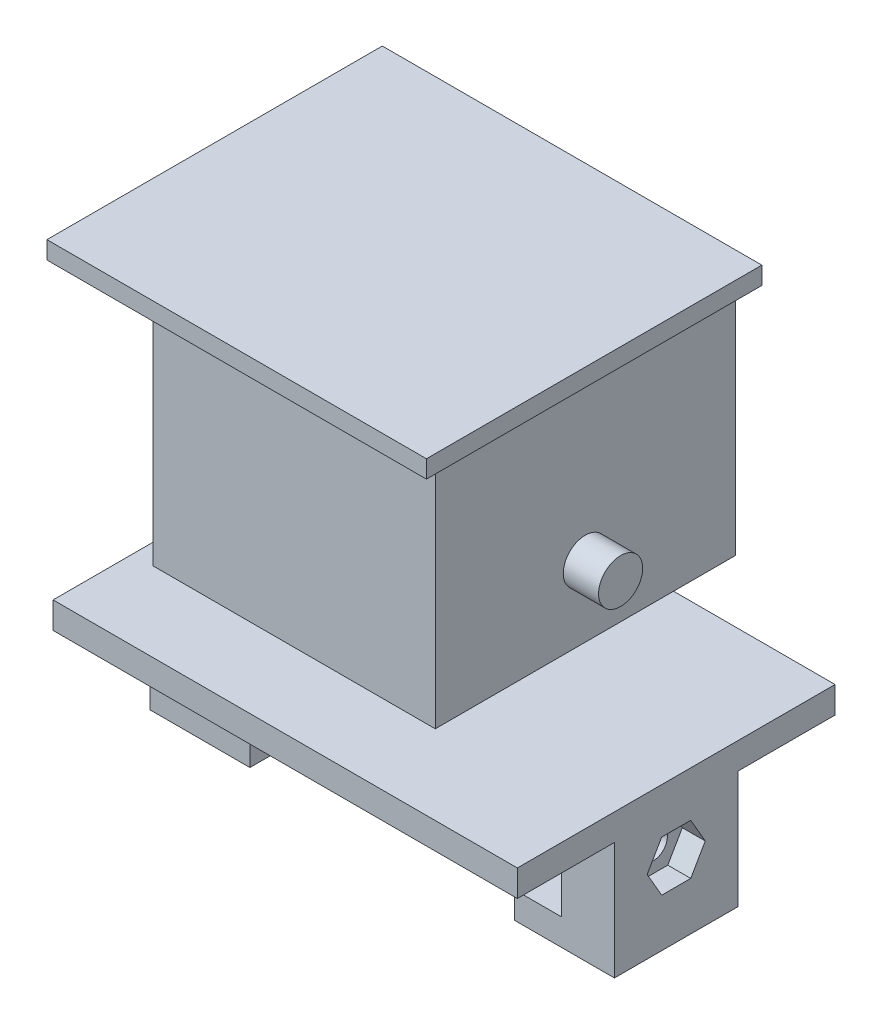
ISO-10303-21;
HEADER;
FILE_DESCRIPTION(('STEP AP214'),'2;1');
FILE_NAME('part.step','',(''),(''),'','','');
FILE_SCHEMA(('AUTOMOTIVE_DESIGN { 1 0 10303 214 1 1 1 1 }'));
ENDSEC;
DATA;
#1=APPLICATION_CONTEXT('core data for automotive mechanical design processes');
#2=APPLICATION_PROTOCOL_DEFINITION('international standard','automotive_design',2000,#1);
#3=PRODUCT_CONTEXT('',#1,'mechanical');
#4=PRODUCT('Part','Part','',(#3));
#5=PRODUCT_RELATED_PRODUCT_CATEGORY('part','',(#4));
#6=PRODUCT_DEFINITION_FORMATION('','',#4);
#7=PRODUCT_DEFINITION_CONTEXT('part definition',#1,'design');
#8=PRODUCT_DEFINITION('design','',#6,#7);
#9=PRODUCT_DEFINITION_SHAPE('','',#8);
#10=(LENGTH_UNIT() NAMED_UNIT(*) SI_UNIT(.MILLI.,.METRE.));
#11=(NAMED_UNIT(*) PLANE_ANGLE_UNIT() SI_UNIT($,.RADIAN.));
#12=(NAMED_UNIT(*) SI_UNIT($,.STERADIAN.) SOLID_ANGLE_UNIT());
#13=UNCERTAINTY_MEASURE_WITH_UNIT(LENGTH_MEASURE(1.E-05),#10,'distance_accuracy_value','');
#14=(GEOMETRIC_REPRESENTATION_CONTEXT(3) GLOBAL_UNCERTAINTY_ASSIGNED_CONTEXT((#13)) GLOBAL_UNIT_ASSIGNED_CONTEXT((#10,
#11,#12)) REPRESENTATION_CONTEXT('',''));
#15=CARTESIAN_POINT('',(0.,0.,0.));
#16=DIRECTION('',(0.,0.,1.));
#17=DIRECTION('',(1.,0.,0.));
#18=AXIS2_PLACEMENT_3D('',#15,#16,#17);
#19=CARTESIAN_POINT('',(-26.3,0.,18.));
#20=DIRECTION('',(1.,0.,0.));
#21=DIRECTION('',(0.,0.,-1.));
#22=AXIS2_PLACEMENT_3D('',#19,#20,#21);
#23=PLANE('',#22);
#24=DIRECTION('',(0.,0.,-1.));
#25=VECTOR('',#24,1.);
#26=CARTESIAN_POINT('',(-26.3,-13.3,7.));
#27=LINE('',#26,#25);
#28=CARTESIAN_POINT('',(-26.3,-13.3,7.));
#29=VERTEX_POINT('',#28);
#30=CARTESIAN_POINT('',(-26.3,-13.3,-7.));
#31=VERTEX_POINT('',#30);
#32=EDGE_CURVE('E554',#29,#31,#27,.T.);
#33=ORIENTED_EDGE('',*,*,#32,.F.);
#34=DIRECTION('',(0.,-1.,0.));
#35=VECTOR('',#34,1.);
#36=CARTESIAN_POINT('',(-26.3,-13.3,7.));
#37=LINE('',#36,#35);
#38=CARTESIAN_POINT('',(-26.3,0.,7.));
#39=VERTEX_POINT('',#38);
#40=EDGE_CURVE('E547',#39,#29,#37,.T.);
#41=ORIENTED_EDGE('',*,*,#40,.F.);
#42=DIRECTION('',(0.,0.,-1.));
#43=VECTOR('',#42,1.);
#44=CARTESIAN_POINT('',(-26.3,0.,18.));
#45=LINE('',#44,#43);
#46=CARTESIAN_POINT('',(-26.3,0.,18.));
#47=VERTEX_POINT('',#46);
#48=EDGE_CURVE('E53',#47,#39,#45,.T.);
#49=ORIENTED_EDGE('',*,*,#48,.F.);
#50=DIRECTION('',(0.,-1.,0.));
#51=VECTOR('',#50,1.);
#52=CARTESIAN_POINT('',(-26.3,0.,18.));
#53=LINE('',#52,#51);
#54=CARTESIAN_POINT('',(-26.3,3.,18.));
#55=VERTEX_POINT('',#54);
#56=EDGE_CURVE('E594',#55,#47,#53,.T.);
#57=ORIENTED_EDGE('',*,*,#56,.F.);
#58=DIRECTION('',(0.,0.,-1.));
#59=VECTOR('',#58,1.);
#60=CARTESIAN_POINT('',(-26.3,3.,18.));
#61=LINE('',#60,#59);
#62=CARTESIAN_POINT('',(-26.3,3.,-18.));
#63=VERTEX_POINT('',#62);
#64=EDGE_CURVE('E604',#55,#63,#61,.T.);
#65=ORIENTED_EDGE('',*,*,#64,.T.);
#66=DIRECTION('',(0.,-1.,0.));
#67=VECTOR('',#66,1.);
#68=CARTESIAN_POINT('',(-26.3,0.,-18.));
#69=LINE('',#68,#67);
#70=CARTESIAN_POINT('',(-26.3,0.,-18.));
#71=VERTEX_POINT('',#70);
#72=EDGE_CURVE('E593',#63,#71,#69,.T.);
#73=ORIENTED_EDGE('',*,*,#72,.T.);
#74=CARTESIAN_POINT('',(-26.3,0.,-7.));
#75=VERTEX_POINT('',#74);
#76=EDGE_CURVE('E622',#75,#71,#45,.T.);
#77=ORIENTED_EDGE('',*,*,#76,.F.);
#78=DIRECTION('',(0.,-1.,0.));
#79=VECTOR('',#78,1.);
#80=CARTESIAN_POINT('',(-26.3,-13.3,-7.));
#81=LINE('',#80,#79);
#82=EDGE_CURVE('E546',#75,#31,#81,.T.);
#83=ORIENTED_EDGE('',*,*,#82,.T.);
#84=EDGE_LOOP('',(#33,#41,#49,#57,#65,#73,#77,#83));
#85=FACE_BOUND('',#84,.T.);
#86=DIRECTION('',(0.,-0.866025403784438,-0.5));
#87=VECTOR('',#86,1.);
#88=CARTESIAN_POINT('',(-26.3,-7.84999999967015,1.645448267));
#89=LINE('',#88,#87);
#90=CARTESIAN_POINT('',(-26.3,-5.,3.290896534));
#91=VERTEX_POINT('',#90);
#92=CARTESIAN_POINT('',(-26.3,-7.84999999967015,1.645448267));
#93=VERTEX_POINT('',#92);
#94=EDGE_CURVE('E61',#91,#93,#89,.T.);
#95=ORIENTED_EDGE('',*,*,#94,.T.);
#96=DIRECTION('',(0.,0.,-1.));
#97=VECTOR('',#96,1.);
#98=CARTESIAN_POINT('',(-26.3,-7.84999999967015,-1.64544826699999));
#99=LINE('',#98,#97);
#100=CARTESIAN_POINT('',(-26.3,-7.84999999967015,-1.64544826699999));
#101=VERTEX_POINT('',#100);
#102=EDGE_CURVE('E324',#93,#101,#99,.T.);
#103=ORIENTED_EDGE('',*,*,#102,.T.);
#104=DIRECTION('',(0.,0.866025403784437,-0.500000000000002));
#105=VECTOR('',#104,1.);
#106=CARTESIAN_POINT('',(-26.3,-5.,-3.290896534));
#107=LINE('',#106,#105);
#108=CARTESIAN_POINT('',(-26.3,-5.,-3.290896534));
#109=VERTEX_POINT('',#108);
#110=EDGE_CURVE('E662',#101,#109,#107,.T.);
#111=ORIENTED_EDGE('',*,*,#110,.T.);
#112=DIRECTION('',(0.,0.866025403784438,0.500000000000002));
#113=VECTOR('',#112,1.);
#114=CARTESIAN_POINT('',(-26.3,-2.15000000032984,-1.64544826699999));
#115=LINE('',#114,#113);
#116=CARTESIAN_POINT('',(-26.3,-2.15000000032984,-1.64544826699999));
#117=VERTEX_POINT('',#116);
#118=EDGE_CURVE('E669',#109,#117,#115,.T.);
#119=ORIENTED_EDGE('',*,*,#118,.T.);
#120=DIRECTION('',(0.,0.,1.));
#121=VECTOR('',#120,1.);
#122=CARTESIAN_POINT('',(-26.3,-2.15000000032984,1.645448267));
#123=LINE('',#122,#121);
#124=CARTESIAN_POINT('',(-26.3,-2.15000000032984,1.645448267));
#125=VERTEX_POINT('',#124);
#126=EDGE_CURVE('E672',#117,#125,#123,.T.);
#127=ORIENTED_EDGE('',*,*,#126,.T.);
#128=DIRECTION('',(0.,-0.866025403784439,0.5));
#129=VECTOR('',#128,1.);
#130=CARTESIAN_POINT('',(-26.3,-5.,3.290896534));
#131=LINE('',#130,#129);
#132=EDGE_CURVE('E320',#125,#91,#131,.T.);
#133=ORIENTED_EDGE('',*,*,#132,.T.);
#134=EDGE_LOOP('',(#95,#103,#111,#119,#127,#133));
#135=FACE_BOUND('',#134,.T.);
#136=ADVANCED_FACE('F45',(#85,#135),#23,.F.);
#137=CARTESIAN_POINT('',(-30.,-5.,0.));
#138=DIRECTION('',(1.,0.,0.));
#139=DIRECTION('',(0.,0.,-1.));
#140=AXIS2_PLACEMENT_3D('',#137,#138,#139);
#141=CYLINDRICAL_SURFACE('',#140,1.6);
#142=CARTESIAN_POINT('',(-20.3,-5.,0.));
#143=DIRECTION('',(-1.,0.,0.));
#144=DIRECTION('',(0.,0.,1.));
#145=AXIS2_PLACEMENT_3D('',#142,#143,#144);
#146=CIRCLE('',#145,1.6);
#147=CARTESIAN_POINT('',(-20.3,-5.,1.6));
#148=VERTEX_POINT('',#147);
#149=EDGE_CURVE('E382',#148,#148,#146,.T.);
#150=ORIENTED_EDGE('',*,*,#149,.F.);
#151=EDGE_LOOP('',(#150));
#152=FACE_BOUND('',#151,.T.);
#153=CARTESIAN_POINT('',(-23.7,-5.,0.));
#154=DIRECTION('',(-1.,0.,0.));
#155=DIRECTION('',(0.,0.,1.));
#156=AXIS2_PLACEMENT_3D('',#153,#154,#155);
#157=CIRCLE('',#156,1.6);
#158=CARTESIAN_POINT('',(-23.7,-5.,1.6));
#159=VERTEX_POINT('',#158);
#160=EDGE_CURVE('E48',#159,#159,#157,.F.);
#161=ORIENTED_EDGE('',*,*,#160,.F.);
#162=EDGE_LOOP('',(#161));
#163=FACE_BOUND('',#162,.T.);
#164=ADVANCED_FACE('F643',(#152,#163),#141,.F.);
#165=CARTESIAN_POINT('',(-20.3,-13.3,7.));
#166=DIRECTION('',(-1.,0.,0.));
#167=DIRECTION('',(0.,0.,1.));
#168=AXIS2_PLACEMENT_3D('',#165,#166,#167);
#169=PLANE('',#168);
#170=ORIENTED_EDGE('',*,*,#149,.T.);
#171=EDGE_LOOP('',(#170));
#172=FACE_BOUND('',#171,.T.);
#173=DIRECTION('',(0.,0.,1.));
#174=VECTOR('',#173,1.);
#175=CARTESIAN_POINT('',(-20.3,-10.3,7.));
#176=LINE('',#175,#174);
#177=CARTESIAN_POINT('',(-20.3,-10.3,-7.));
#178=VERTEX_POINT('',#177);
#179=CARTESIAN_POINT('',(-20.3,-10.3,7.));
#180=VERTEX_POINT('',#179);
#181=EDGE_CURVE('E524',#178,#180,#176,.T.);
#182=ORIENTED_EDGE('',*,*,#181,.F.);
#183=DIRECTION('',(0.,1.,0.));
#184=VECTOR('',#183,1.);
#185=CARTESIAN_POINT('',(-20.3,-13.3,-7.));
#186=LINE('',#185,#184);
#187=CARTESIAN_POINT('',(-20.3,0.,-7.));
#188=VERTEX_POINT('',#187);
#189=EDGE_CURVE('E550',#178,#188,#186,.T.);
#190=ORIENTED_EDGE('',*,*,#189,.T.);
#191=DIRECTION('',(0.,0.,1.));
#192=VECTOR('',#191,1.);
#193=CARTESIAN_POINT('',(-20.3,0.,18.));
#194=LINE('',#193,#192);
#195=CARTESIAN_POINT('',(-20.3,0.,7.));
#196=VERTEX_POINT('',#195);
#197=EDGE_CURVE('E566',#188,#196,#194,.T.);
#198=ORIENTED_EDGE('',*,*,#197,.T.);
#199=DIRECTION('',(0.,1.,0.));
#200=VECTOR('',#199,1.);
#201=CARTESIAN_POINT('',(-20.3,-13.3,7.));
#202=LINE('',#201,#200);
#203=EDGE_CURVE('E552',#180,#196,#202,.T.);
#204=ORIENTED_EDGE('',*,*,#203,.F.);
#205=EDGE_LOOP('',(#182,#190,#198,#204));
#206=FACE_BOUND('',#205,.T.);
#207=ADVANCED_FACE('F652',(#172,#206),#169,.F.);
#208=CARTESIAN_POINT('',(20.3,-13.3,7.));
#209=DIRECTION('',(1.,0.,0.));
#210=DIRECTION('',(0.,0.,-1.));
#211=AXIS2_PLACEMENT_3D('',#208,#209,#210);
#212=PLANE('',#211);
#213=CARTESIAN_POINT('',(20.3,-5.,0.));
#214=DIRECTION('',(1.,0.,0.));
#215=DIRECTION('',(0.,0.,-1.));
#216=AXIS2_PLACEMENT_3D('',#213,#214,#215);
#217=CIRCLE('',#216,1.6);
#218=CARTESIAN_POINT('',(20.3,-5.,-1.6));
#219=VERTEX_POINT('',#218);
#220=EDGE_CURVE('E379',#219,#219,#217,.T.);
#221=ORIENTED_EDGE('',*,*,#220,.T.);
#222=EDGE_LOOP('',(#221));
#223=FACE_BOUND('',#222,.T.);
#224=DIRECTION('',(0.,0.,-1.));
#225=VECTOR('',#224,1.);
#226=CARTESIAN_POINT('',(20.3,-10.3,7.));
#227=LINE('',#226,#225);
#228=CARTESIAN_POINT('',(20.3,-10.3,7.));
#229=VERTEX_POINT('',#228);
#230=CARTESIAN_POINT('',(20.3,-10.3,-7.));
#231=VERTEX_POINT('',#230);
#232=EDGE_CURVE('E543',#229,#231,#227,.T.);
#233=ORIENTED_EDGE('',*,*,#232,.F.);
#234=DIRECTION('',(0.,-1.,0.));
#235=VECTOR('',#234,1.);
#236=CARTESIAN_POINT('',(20.3,-13.3,7.));
#237=LINE('',#236,#235);
#238=CARTESIAN_POINT('',(20.3,0.,7.));
#239=VERTEX_POINT('',#238);
#240=EDGE_CURVE('E570',#239,#229,#237,.T.);
#241=ORIENTED_EDGE('',*,*,#240,.F.);
#242=DIRECTION('',(0.,0.,-1.));
#243=VECTOR('',#242,1.);
#244=CARTESIAN_POINT('',(20.3,0.,18.));
#245=LINE('',#244,#243);
#246=CARTESIAN_POINT('',(20.3,0.,-7.));
#247=VERTEX_POINT('',#246);
#248=EDGE_CURVE('E590',#239,#247,#245,.T.);
#249=ORIENTED_EDGE('',*,*,#248,.T.);
#250=DIRECTION('',(0.,-1.,0.));
#251=VECTOR('',#250,1.);
#252=CARTESIAN_POINT('',(20.3,-13.3,-7.));
#253=LINE('',#252,#251);
#254=EDGE_CURVE('E569',#247,#231,#253,.T.);
#255=ORIENTED_EDGE('',*,*,#254,.T.);
#256=EDGE_LOOP('',(#233,#241,#249,#255));
#257=FACE_BOUND('',#256,.T.);
#258=ADVANCED_FACE('F865',(#223,#257),#212,.F.);
#259=CARTESIAN_POINT('',(-26.3,0.,18.));
#260=DIRECTION('',(0.,1.,0.));
#261=DIRECTION('',(0.,0.,1.));
#262=AXIS2_PLACEMENT_3D('',#259,#260,#261);
#263=PLANE('',#262);
#264=DIRECTION('',(-1.,0.,0.));
#265=VECTOR('',#264,1.);
#266=CARTESIAN_POINT('',(-26.3,0.,7.));
#267=LINE('',#266,#265);
#268=EDGE_CURVE('E564',#196,#39,#267,.T.);
#269=ORIENTED_EDGE('',*,*,#268,.F.);
#270=ORIENTED_EDGE('',*,*,#197,.F.);
#271=DIRECTION('',(-1.,0.,0.));
#272=VECTOR('',#271,1.);
#273=CARTESIAN_POINT('',(-26.3,0.,-7.));
#274=LINE('',#273,#272);
#275=EDGE_CURVE('E561',#188,#75,#274,.T.);
#276=ORIENTED_EDGE('',*,*,#275,.T.);
#277=ORIENTED_EDGE('',*,*,#76,.T.);
#278=DIRECTION('',(1.,0.,0.));
#279=VECTOR('',#278,1.);
#280=CARTESIAN_POINT('',(-26.3,0.,-18.));
#281=LINE('',#280,#279);
#282=CARTESIAN_POINT('',(26.3,0.,-18.));
#283=VERTEX_POINT('',#282);
#284=EDGE_CURVE('E607',#71,#283,#281,.T.);
#285=ORIENTED_EDGE('',*,*,#284,.T.);
#286=DIRECTION('',(0.,0.,-1.));
#287=VECTOR('',#286,1.);
#288=CARTESIAN_POINT('',(26.3,0.,18.));
#289=LINE('',#288,#287);
#290=CARTESIAN_POINT('',(26.3,0.,-7.));
#291=VERTEX_POINT('',#290);
#292=EDGE_CURVE('E618',#291,#283,#289,.T.);
#293=ORIENTED_EDGE('',*,*,#292,.F.);
#294=DIRECTION('',(-1.,0.,0.));
#295=VECTOR('',#294,1.);
#296=CARTESIAN_POINT('',(-26.3,0.,-7.));
#297=LINE('',#296,#295);
#298=EDGE_CURVE('E585',#291,#247,#297,.T.);
#299=ORIENTED_EDGE('',*,*,#298,.T.);
#300=ORIENTED_EDGE('',*,*,#248,.F.);
#301=DIRECTION('',(-1.,0.,0.));
#302=VECTOR('',#301,1.);
#303=CARTESIAN_POINT('',(-26.3,0.,7.));
#304=LINE('',#303,#302);
#305=CARTESIAN_POINT('',(26.3,0.,7.));
#306=VERTEX_POINT('',#305);
#307=EDGE_CURVE('E588',#306,#239,#304,.T.);
#308=ORIENTED_EDGE('',*,*,#307,.F.);
#309=CARTESIAN_POINT('',(26.3,0.,18.));
#310=VERTEX_POINT('',#309);
#311=EDGE_CURVE('E619',#310,#306,#289,.T.);
#312=ORIENTED_EDGE('',*,*,#311,.F.);
#313=DIRECTION('',(1.,0.,0.));
#314=VECTOR('',#313,1.);
#315=CARTESIAN_POINT('',(-26.3,0.,18.));
#316=LINE('',#315,#314);
#317=EDGE_CURVE('E597',#47,#310,#316,.T.);
#318=ORIENTED_EDGE('',*,*,#317,.F.);
#319=ORIENTED_EDGE('',*,*,#48,.T.);
#320=EDGE_LOOP('',(#269,#270,#276,#277,#285,#293,#299,#300,#308,#312,#318,#319));
#321=FACE_BOUND('',#320,.T.);
#322=ADVANCED_FACE('F884',(#321),#263,.F.);
#323=CARTESIAN_POINT('',(26.3,0.,18.));
#324=DIRECTION('',(-1.,0.,0.));
#325=DIRECTION('',(0.,0.,1.));
#326=AXIS2_PLACEMENT_3D('',#323,#324,#325);
#327=PLANE('',#326);
#328=DIRECTION('',(0.,0.,-1.));
#329=VECTOR('',#328,1.);
#330=CARTESIAN_POINT('',(26.3,-7.84999999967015,-1.64544826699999));
#331=LINE('',#330,#329);
#332=CARTESIAN_POINT('',(26.3,-7.84999999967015,1.645448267));
#333=VERTEX_POINT('',#332);
#334=CARTESIAN_POINT('',(26.3,-7.84999999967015,-1.64544826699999));
#335=VERTEX_POINT('',#334);
#336=EDGE_CURVE('E353',#333,#335,#331,.T.);
#337=ORIENTED_EDGE('',*,*,#336,.F.);
#338=DIRECTION('',(0.,-0.866025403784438,-0.5));
#339=VECTOR('',#338,1.);
#340=CARTESIAN_POINT('',(26.3,-7.84999999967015,1.645448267));
#341=LINE('',#340,#339);
#342=CARTESIAN_POINT('',(26.3,-5.,3.290896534));
#343=VERTEX_POINT('',#342);
#344=EDGE_CURVE('E69',#343,#333,#341,.T.);
#345=ORIENTED_EDGE('',*,*,#344,.F.);
#346=DIRECTION('',(0.,-0.866025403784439,0.5));
#347=VECTOR('',#346,1.);
#348=CARTESIAN_POINT('',(26.3,-5.,3.290896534));
#349=LINE('',#348,#347);
#350=CARTESIAN_POINT('',(26.3,-2.15000000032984,1.645448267));
#351=VERTEX_POINT('',#350);
#352=EDGE_CURVE('E336',#351,#343,#349,.T.);
#353=ORIENTED_EDGE('',*,*,#352,.F.);
#354=DIRECTION('',(0.,0.,1.));
#355=VECTOR('',#354,1.);
#356=CARTESIAN_POINT('',(26.3,-2.15000000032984,1.645448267));
#357=LINE('',#356,#355);
#358=CARTESIAN_POINT('',(26.3,-2.15000000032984,-1.64544826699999));
#359=VERTEX_POINT('',#358);
#360=EDGE_CURVE('E362',#359,#351,#357,.T.);
#361=ORIENTED_EDGE('',*,*,#360,.F.);
#362=DIRECTION('',(0.,0.866025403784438,0.500000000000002));
#363=VECTOR('',#362,1.);
#364=CARTESIAN_POINT('',(26.3,-2.15000000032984,-1.64544826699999));
#365=LINE('',#364,#363);
#366=CARTESIAN_POINT('',(26.3,-5.,-3.290896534));
#367=VERTEX_POINT('',#366);
#368=EDGE_CURVE('E359',#367,#359,#365,.T.);
#369=ORIENTED_EDGE('',*,*,#368,.F.);
#370=DIRECTION('',(0.,0.866025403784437,-0.500000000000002));
#371=VECTOR('',#370,1.);
#372=CARTESIAN_POINT('',(26.3,-5.,-3.290896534));
#373=LINE('',#372,#371);
#374=EDGE_CURVE('E356',#335,#367,#373,.T.);
#375=ORIENTED_EDGE('',*,*,#374,.F.);
#376=EDGE_LOOP('',(#337,#345,#353,#361,#369,#375));
#377=FACE_BOUND('',#376,.T.);
#378=DIRECTION('',(0.,1.,0.));
#379=VECTOR('',#378,1.);
#380=CARTESIAN_POINT('',(26.3,-13.3,-7.));
#381=LINE('',#380,#379);
#382=CARTESIAN_POINT('',(26.3,-13.3,-7.));
#383=VERTEX_POINT('',#382);
#384=EDGE_CURVE('E574',#383,#291,#381,.T.);
#385=ORIENTED_EDGE('',*,*,#384,.T.);
#386=ORIENTED_EDGE('',*,*,#292,.T.);
#387=DIRECTION('',(0.,1.,0.));
#388=VECTOR('',#387,1.);
#389=CARTESIAN_POINT('',(26.3,0.,-18.));
#390=LINE('',#389,#388);
#391=CARTESIAN_POINT('',(26.3,3.,-18.));
#392=VERTEX_POINT('',#391);
#393=EDGE_CURVE('E610',#283,#392,#390,.T.);
#394=ORIENTED_EDGE('',*,*,#393,.T.);
#395=DIRECTION('',(0.,0.,-1.));
#396=VECTOR('',#395,1.);
#397=CARTESIAN_POINT('',(26.3,3.,18.));
#398=LINE('',#397,#396);
#399=CARTESIAN_POINT('',(26.3,3.,18.));
#400=VERTEX_POINT('',#399);
#401=EDGE_CURVE('E616',#400,#392,#398,.T.);
#402=ORIENTED_EDGE('',*,*,#401,.F.);
#403=DIRECTION('',(0.,1.,0.));
#404=VECTOR('',#403,1.);
#405=CARTESIAN_POINT('',(26.3,0.,18.));
#406=LINE('',#405,#404);
#407=EDGE_CURVE('E600',#310,#400,#406,.T.);
#408=ORIENTED_EDGE('',*,*,#407,.F.);
#409=ORIENTED_EDGE('',*,*,#311,.T.);
#410=DIRECTION('',(0.,1.,0.));
#411=VECTOR('',#410,1.);
#412=CARTESIAN_POINT('',(26.3,-13.3,7.));
#413=LINE('',#412,#411);
#414=CARTESIAN_POINT('',(26.3,-13.3,7.));
#415=VERTEX_POINT('',#414);
#416=EDGE_CURVE('E576',#415,#306,#413,.T.);
#417=ORIENTED_EDGE('',*,*,#416,.F.);
#418=DIRECTION('',(0.,0.,-1.));
#419=VECTOR('',#418,1.);
#420=CARTESIAN_POINT('',(26.3,-13.3,7.));
#421=LINE('',#420,#419);
#422=EDGE_CURVE('E578',#415,#383,#421,.T.);
#423=ORIENTED_EDGE('',*,*,#422,.T.);
#424=EDGE_LOOP('',(#385,#386,#394,#402,#408,#409,#417,#423));
#425=FACE_BOUND('',#424,.T.);
#426=ADVANCED_FACE('F896',(#377,#425),#327,.F.);
#427=CARTESIAN_POINT('',(-26.3,3.,18.));
#428=DIRECTION('',(0.,-1.,0.));
#429=DIRECTION('',(0.,0.,-1.));
#430=AXIS2_PLACEMENT_3D('',#427,#428,#429);
#431=PLANE('',#430);
#432=DIRECTION('',(0.,0.,-1.));
#433=VECTOR('',#432,1.);
#434=CARTESIAN_POINT('',(-7.,3.,7.));
#435=LINE('',#434,#433);
#436=CARTESIAN_POINT('',(-7.,3.,7.));
#437=VERTEX_POINT('',#436);
#438=CARTESIAN_POINT('',(-7.,3.,-7.));
#439=VERTEX_POINT('',#438);
#440=EDGE_CURVE('E505',#437,#439,#435,.T.);
#441=ORIENTED_EDGE('',*,*,#440,.T.);
#442=DIRECTION('',(1.,0.,0.));
#443=VECTOR('',#442,1.);
#444=CARTESIAN_POINT('',(-7.,3.,-7.));
#445=LINE('',#444,#443);
#446=CARTESIAN_POINT('',(7.,3.,-7.));
#447=VERTEX_POINT('',#446);
#448=EDGE_CURVE('E491',#439,#447,#445,.T.);
#449=ORIENTED_EDGE('',*,*,#448,.T.);
#450=DIRECTION('',(0.,0.,-1.));
#451=VECTOR('',#450,1.);
#452=CARTESIAN_POINT('',(7.,3.,7.));
#453=LINE('',#452,#451);
#454=CARTESIAN_POINT('',(7.,3.,7.));
#455=VERTEX_POINT('',#454);
#456=EDGE_CURVE('E503',#455,#447,#453,.T.);
#457=ORIENTED_EDGE('',*,*,#456,.F.);
#458=DIRECTION('',(1.,0.,0.));
#459=VECTOR('',#458,1.);
#460=CARTESIAN_POINT('',(-7.,3.,7.));
#461=LINE('',#460,#459);
#462=EDGE_CURVE('E482',#437,#455,#461,.T.);
#463=ORIENTED_EDGE('',*,*,#462,.F.);
#464=EDGE_LOOP('',(#441,#449,#457,#463));
#465=FACE_BOUND('',#464,.T.);
#466=DIRECTION('',(-1.,0.,0.));
#467=VECTOR('',#466,1.);
#468=CARTESIAN_POINT('',(-26.3,3.,-18.));
#469=LINE('',#468,#467);
#470=EDGE_CURVE('E598',#392,#63,#469,.T.);
#471=ORIENTED_EDGE('',*,*,#470,.T.);
#472=ORIENTED_EDGE('',*,*,#64,.F.);
#473=DIRECTION('',(-1.,0.,0.));
#474=VECTOR('',#473,1.);
#475=CARTESIAN_POINT('',(-26.3,3.,18.));
#476=LINE('',#475,#474);
#477=EDGE_CURVE('E602',#400,#55,#476,.T.);
#478=ORIENTED_EDGE('',*,*,#477,.F.);
#479=ORIENTED_EDGE('',*,*,#401,.T.);
#480=EDGE_LOOP('',(#471,#472,#478,#479));
#481=FACE_BOUND('',#480,.T.);
#482=ADVANCED_FACE('F889',(#465,#481),#431,.F.);
#483=CARTESIAN_POINT('',(0.,0.,18.));
#484=DIRECTION('',(0.,0.,-1.));
#485=DIRECTION('',(-1.,0.,0.));
#486=AXIS2_PLACEMENT_3D('',#483,#484,#485);
#487=PLANE('',#486);
#488=ORIENTED_EDGE('',*,*,#56,.T.);
#489=ORIENTED_EDGE('',*,*,#317,.T.);
#490=ORIENTED_EDGE('',*,*,#407,.T.);
#491=ORIENTED_EDGE('',*,*,#477,.T.);
#492=EDGE_LOOP('',(#488,#489,#490,#491));
#493=FACE_BOUND('',#492,.T.);
#494=ADVANCED_FACE('F886',(#493),#487,.F.);
#495=CARTESIAN_POINT('',(0.,0.,-18.));
#496=DIRECTION('',(0.,0.,-1.));
#497=DIRECTION('',(-1.,0.,0.));
#498=AXIS2_PLACEMENT_3D('',#495,#496,#497);
#499=PLANE('',#498);
#500=ORIENTED_EDGE('',*,*,#72,.F.);
#501=ORIENTED_EDGE('',*,*,#470,.F.);
#502=ORIENTED_EDGE('',*,*,#393,.F.);
#503=ORIENTED_EDGE('',*,*,#284,.F.);
#504=EDGE_LOOP('',(#500,#501,#502,#503));
#505=FACE_BOUND('',#504,.T.);
#506=ADVANCED_FACE('F874',(#505),#499,.T.);
#507=CARTESIAN_POINT('',(0.,0.,7.));
#508=DIRECTION('',(0.,0.,-1.));
#509=DIRECTION('',(-1.,0.,0.));
#510=AXIS2_PLACEMENT_3D('',#507,#508,#509);
#511=PLANE('',#510);
#512=ORIENTED_EDGE('',*,*,#416,.T.);
#513=ORIENTED_EDGE('',*,*,#307,.T.);
#514=ORIENTED_EDGE('',*,*,#240,.T.);
#515=DIRECTION('',(-1.,0.,0.));
#516=VECTOR('',#515,1.);
#517=CARTESIAN_POINT('',(15.,-10.3,7.));
#518=LINE('',#517,#516);
#519=CARTESIAN_POINT('',(15.,-10.3,7.));
#520=VERTEX_POINT('',#519);
#521=EDGE_CURVE('E531',#229,#520,#518,.T.);
#522=ORIENTED_EDGE('',*,*,#521,.T.);
#523=DIRECTION('',(0.,-1.,0.));
#524=VECTOR('',#523,1.);
#525=CARTESIAN_POINT('',(15.,-13.3,7.));
#526=LINE('',#525,#524);
#527=CARTESIAN_POINT('',(15.,-13.3,7.));
#528=VERTEX_POINT('',#527);
#529=EDGE_CURVE('E528',#520,#528,#526,.T.);
#530=ORIENTED_EDGE('',*,*,#529,.T.);
#531=DIRECTION('',(1.,0.,0.));
#532=VECTOR('',#531,1.);
#533=CARTESIAN_POINT('',(20.3,-13.3,7.));
#534=LINE('',#533,#532);
#535=EDGE_CURVE('E573',#528,#415,#534,.T.);
#536=ORIENTED_EDGE('',*,*,#535,.T.);
#537=EDGE_LOOP('',(#512,#513,#514,#522,#530,#536));
#538=FACE_BOUND('',#537,.T.);
#539=ADVANCED_FACE('F870',(#538),#511,.F.);
#540=CARTESIAN_POINT('',(0.,0.,-7.));
#541=DIRECTION('',(0.,0.,-1.));
#542=DIRECTION('',(-1.,0.,0.));
#543=AXIS2_PLACEMENT_3D('',#540,#541,#542);
#544=PLANE('',#543);
#545=DIRECTION('',(1.,0.,0.));
#546=VECTOR('',#545,1.);
#547=CARTESIAN_POINT('',(20.3,-13.3,-7.));
#548=LINE('',#547,#546);
#549=CARTESIAN_POINT('',(15.,-13.3,-7.));
#550=VERTEX_POINT('',#549);
#551=EDGE_CURVE('E580',#550,#383,#548,.T.);
#552=ORIENTED_EDGE('',*,*,#551,.F.);
#553=DIRECTION('',(0.,-1.,0.));
#554=VECTOR('',#553,1.);
#555=CARTESIAN_POINT('',(15.,-13.3,-7.));
#556=LINE('',#555,#554);
#557=CARTESIAN_POINT('',(15.,-10.3,-7.));
#558=VERTEX_POINT('',#557);
#559=EDGE_CURVE('E527',#558,#550,#556,.T.);
#560=ORIENTED_EDGE('',*,*,#559,.F.);
#561=DIRECTION('',(-1.,0.,0.));
#562=VECTOR('',#561,1.);
#563=CARTESIAN_POINT('',(15.,-10.3,-7.));
#564=LINE('',#563,#562);
#565=EDGE_CURVE('E532',#231,#558,#564,.T.);
#566=ORIENTED_EDGE('',*,*,#565,.F.);
#567=ORIENTED_EDGE('',*,*,#254,.F.);
#568=ORIENTED_EDGE('',*,*,#298,.F.);
#569=ORIENTED_EDGE('',*,*,#384,.F.);
#570=EDGE_LOOP('',(#552,#560,#566,#567,#568,#569));
#571=FACE_BOUND('',#570,.T.);
#572=ADVANCED_FACE('F873',(#571),#544,.T.);
#573=CARTESIAN_POINT('',(20.3,-13.3,7.));
#574=DIRECTION('',(0.,1.,0.));
#575=DIRECTION('',(0.,0.,1.));
#576=AXIS2_PLACEMENT_3D('',#573,#574,#575);
#577=PLANE('',#576);
#578=ORIENTED_EDGE('',*,*,#551,.T.);
#579=ORIENTED_EDGE('',*,*,#422,.F.);
#580=ORIENTED_EDGE('',*,*,#535,.F.);
#581=DIRECTION('',(0.,0.,-1.));
#582=VECTOR('',#581,1.);
#583=CARTESIAN_POINT('',(15.,-13.3,7.));
#584=LINE('',#583,#582);
#585=EDGE_CURVE('E540',#528,#550,#584,.T.);
#586=ORIENTED_EDGE('',*,*,#585,.T.);
#587=EDGE_LOOP('',(#578,#579,#580,#586));
#588=FACE_BOUND('',#587,.T.);
#589=ADVANCED_FACE('F859',(#588),#577,.F.);
#590=CARTESIAN_POINT('',(0.,0.,7.));
#591=DIRECTION('',(0.,0.,-1.));
#592=DIRECTION('',(-1.,0.,0.));
#593=AXIS2_PLACEMENT_3D('',#590,#591,#592);
#594=PLANE('',#593);
#595=DIRECTION('',(1.,0.,0.));
#596=VECTOR('',#595,1.);
#597=CARTESIAN_POINT('',(-26.3,-13.3,7.));
#598=LINE('',#597,#596);
#599=CARTESIAN_POINT('',(-15.,-13.3,7.));
#600=VERTEX_POINT('',#599);
#601=EDGE_CURVE('E549',#29,#600,#598,.T.);
#602=ORIENTED_EDGE('',*,*,#601,.T.);
#603=DIRECTION('',(0.,1.,0.));
#604=VECTOR('',#603,1.);
#605=CARTESIAN_POINT('',(-15.,-13.3,7.));
#606=LINE('',#605,#604);
#607=CARTESIAN_POINT('',(-15.,-10.3,7.));
#608=VERTEX_POINT('',#607);
#609=EDGE_CURVE('E509',#600,#608,#606,.T.);
#610=ORIENTED_EDGE('',*,*,#609,.T.);
#611=DIRECTION('',(-1.,0.,0.));
#612=VECTOR('',#611,1.);
#613=CARTESIAN_POINT('',(-26.3,-10.3,7.));
#614=LINE('',#613,#612);
#615=EDGE_CURVE('E511',#608,#180,#614,.T.);
#616=ORIENTED_EDGE('',*,*,#615,.T.);
#617=ORIENTED_EDGE('',*,*,#203,.T.);
#618=ORIENTED_EDGE('',*,*,#268,.T.);
#619=ORIENTED_EDGE('',*,*,#40,.T.);
#620=EDGE_LOOP('',(#602,#610,#616,#617,#618,#619));
#621=FACE_BOUND('',#620,.T.);
#622=ADVANCED_FACE('F855',(#621),#594,.F.);
#623=CARTESIAN_POINT('',(0.,0.,-7.));
#624=DIRECTION('',(0.,0.,-1.));
#625=DIRECTION('',(-1.,0.,0.));
#626=AXIS2_PLACEMENT_3D('',#623,#624,#625);
#627=PLANE('',#626);
#628=DIRECTION('',(1.,0.,0.));
#629=VECTOR('',#628,1.);
#630=CARTESIAN_POINT('',(-26.3,-13.3,-7.));
#631=LINE('',#630,#629);
#632=CARTESIAN_POINT('',(-15.,-13.3,-7.));
#633=VERTEX_POINT('',#632);
#634=EDGE_CURVE('E556',#31,#633,#631,.T.);
#635=ORIENTED_EDGE('',*,*,#634,.F.);
#636=ORIENTED_EDGE('',*,*,#82,.F.);
#637=ORIENTED_EDGE('',*,*,#275,.F.);
#638=ORIENTED_EDGE('',*,*,#189,.F.);
#639=DIRECTION('',(-1.,0.,0.));
#640=VECTOR('',#639,1.);
#641=CARTESIAN_POINT('',(-26.3,-10.3,-7.));
#642=LINE('',#641,#640);
#643=CARTESIAN_POINT('',(-15.,-10.3,-7.));
#644=VERTEX_POINT('',#643);
#645=EDGE_CURVE('E512',#644,#178,#642,.T.);
#646=ORIENTED_EDGE('',*,*,#645,.F.);
#647=DIRECTION('',(0.,1.,0.));
#648=VECTOR('',#647,1.);
#649=CARTESIAN_POINT('',(-15.,-13.3,-7.));
#650=LINE('',#649,#648);
#651=EDGE_CURVE('E508',#633,#644,#650,.T.);
#652=ORIENTED_EDGE('',*,*,#651,.F.);
#653=EDGE_LOOP('',(#635,#636,#637,#638,#646,#652));
#654=FACE_BOUND('',#653,.T.);
#655=ADVANCED_FACE('F858',(#654),#627,.T.);
#656=CARTESIAN_POINT('',(-26.3,-13.3,7.));
#657=DIRECTION('',(0.,1.,0.));
#658=DIRECTION('',(0.,0.,1.));
#659=AXIS2_PLACEMENT_3D('',#656,#657,#658);
#660=PLANE('',#659);
#661=ORIENTED_EDGE('',*,*,#634,.T.);
#662=DIRECTION('',(0.,0.,-1.));
#663=VECTOR('',#662,1.);
#664=CARTESIAN_POINT('',(-15.,-13.3,7.));
#665=LINE('',#664,#663);
#666=EDGE_CURVE('E521',#600,#633,#665,.T.);
#667=ORIENTED_EDGE('',*,*,#666,.F.);
#668=ORIENTED_EDGE('',*,*,#601,.F.);
#669=ORIENTED_EDGE('',*,*,#32,.T.);
#670=EDGE_LOOP('',(#661,#667,#668,#669));
#671=FACE_BOUND('',#670,.T.);
#672=ADVANCED_FACE('F850',(#671),#660,.F.);
#673=CARTESIAN_POINT('',(15.,-10.3,7.));
#674=DIRECTION('',(0.,-1.,0.));
#675=DIRECTION('',(0.,0.,-1.));
#676=AXIS2_PLACEMENT_3D('',#673,#674,#675);
#677=PLANE('',#676);
#678=ORIENTED_EDGE('',*,*,#521,.F.);
#679=ORIENTED_EDGE('',*,*,#232,.T.);
#680=ORIENTED_EDGE('',*,*,#565,.T.);
#681=DIRECTION('',(0.,0.,-1.));
#682=VECTOR('',#681,1.);
#683=CARTESIAN_POINT('',(15.,-10.3,7.));
#684=LINE('',#683,#682);
#685=EDGE_CURVE('E534',#520,#558,#684,.T.);
#686=ORIENTED_EDGE('',*,*,#685,.F.);
#687=EDGE_LOOP('',(#678,#679,#680,#686));
#688=FACE_BOUND('',#687,.T.);
#689=ADVANCED_FACE('F847',(#688),#677,.F.);
#690=CARTESIAN_POINT('',(15.,-13.3,7.));
#691=DIRECTION('',(1.,0.,0.));
#692=DIRECTION('',(0.,0.,-1.));
#693=AXIS2_PLACEMENT_3D('',#690,#691,#692);
#694=PLANE('',#693);
#695=ORIENTED_EDGE('',*,*,#559,.T.);
#696=ORIENTED_EDGE('',*,*,#585,.F.);
#697=ORIENTED_EDGE('',*,*,#529,.F.);
#698=ORIENTED_EDGE('',*,*,#685,.T.);
#699=EDGE_LOOP('',(#695,#696,#697,#698));
#700=FACE_BOUND('',#699,.T.);
#701=ADVANCED_FACE('F842',(#700),#694,.F.);
#702=CARTESIAN_POINT('',(-26.3,-10.3,7.));
#703=DIRECTION('',(0.,-1.,0.));
#704=DIRECTION('',(0.,0.,-1.));
#705=AXIS2_PLACEMENT_3D('',#702,#703,#704);
#706=PLANE('',#705);
#707=ORIENTED_EDGE('',*,*,#645,.T.);
#708=ORIENTED_EDGE('',*,*,#181,.T.);
#709=ORIENTED_EDGE('',*,*,#615,.F.);
#710=DIRECTION('',(0.,0.,-1.));
#711=VECTOR('',#710,1.);
#712=CARTESIAN_POINT('',(-15.,-10.3,7.));
#713=LINE('',#712,#711);
#714=EDGE_CURVE('E515',#608,#644,#713,.T.);
#715=ORIENTED_EDGE('',*,*,#714,.T.);
#716=EDGE_LOOP('',(#707,#708,#709,#715));
#717=FACE_BOUND('',#716,.T.);
#718=ADVANCED_FACE('F839',(#717),#706,.F.);
#719=CARTESIAN_POINT('',(-15.,-13.3,7.));
#720=DIRECTION('',(-1.,0.,0.));
#721=DIRECTION('',(0.,0.,1.));
#722=AXIS2_PLACEMENT_3D('',#719,#720,#721);
#723=PLANE('',#722);
#724=ORIENTED_EDGE('',*,*,#651,.T.);
#725=ORIENTED_EDGE('',*,*,#714,.F.);
#726=ORIENTED_EDGE('',*,*,#609,.F.);
#727=ORIENTED_EDGE('',*,*,#666,.T.);
#728=EDGE_LOOP('',(#724,#725,#726,#727));
#729=FACE_BOUND('',#728,.T.);
#730=ADVANCED_FACE('F837',(#729),#723,.F.);
#731=CARTESIAN_POINT('',(-7.,3.,7.));
#732=DIRECTION('',(1.,0.,0.));
#733=DIRECTION('',(0.,0.,-1.));
#734=AXIS2_PLACEMENT_3D('',#731,#732,#733);
#735=PLANE('',#734);
#736=DIRECTION('',(0.,-1.,0.));
#737=VECTOR('',#736,1.);
#738=CARTESIAN_POINT('',(-7.,3.,-7.));
#739=LINE('',#738,#737);
#740=CARTESIAN_POINT('',(-7.,11.,-7.));
#741=VERTEX_POINT('',#740);
#742=EDGE_CURVE('E479',#741,#439,#739,.T.);
#743=ORIENTED_EDGE('',*,*,#742,.T.);
#744=ORIENTED_EDGE('',*,*,#440,.F.);
#745=DIRECTION('',(0.,-1.,0.));
#746=VECTOR('',#745,1.);
#747=CARTESIAN_POINT('',(-7.,3.,7.));
#748=LINE('',#747,#746);
#749=CARTESIAN_POINT('',(-7.,11.,7.));
#750=VERTEX_POINT('',#749);
#751=EDGE_CURVE('E480',#750,#437,#748,.T.);
#752=ORIENTED_EDGE('',*,*,#751,.F.);
#753=DIRECTION('',(0.,0.,-1.));
#754=VECTOR('',#753,1.);
#755=CARTESIAN_POINT('',(-7.,11.,7.));
#756=LINE('',#755,#754);
#757=EDGE_CURVE('E489',#750,#741,#756,.T.);
#758=ORIENTED_EDGE('',*,*,#757,.T.);
#759=EDGE_LOOP('',(#743,#744,#752,#758));
#760=FACE_BOUND('',#759,.T.);
#761=ADVANCED_FACE('F833',(#760),#735,.F.);
#762=CARTESIAN_POINT('',(7.,3.,7.));
#763=DIRECTION('',(-1.,0.,0.));
#764=DIRECTION('',(0.,0.,1.));
#765=AXIS2_PLACEMENT_3D('',#762,#763,#764);
#766=PLANE('',#765);
#767=DIRECTION('',(0.,1.,0.));
#768=VECTOR('',#767,1.);
#769=CARTESIAN_POINT('',(7.,3.,-7.));
#770=LINE('',#769,#768);
#771=CARTESIAN_POINT('',(7.,11.,-7.));
#772=VERTEX_POINT('',#771);
#773=EDGE_CURVE('E494',#447,#772,#770,.T.);
#774=ORIENTED_EDGE('',*,*,#773,.T.);
#775=DIRECTION('',(0.,0.,-1.));
#776=VECTOR('',#775,1.);
#777=CARTESIAN_POINT('',(7.,11.,7.));
#778=LINE('',#777,#776);
#779=CARTESIAN_POINT('',(7.,11.,7.));
#780=VERTEX_POINT('',#779);
#781=EDGE_CURVE('E500',#780,#772,#778,.T.);
#782=ORIENTED_EDGE('',*,*,#781,.F.);
#783=DIRECTION('',(0.,1.,0.));
#784=VECTOR('',#783,1.);
#785=CARTESIAN_POINT('',(7.,3.,7.));
#786=LINE('',#785,#784);
#787=EDGE_CURVE('E485',#455,#780,#786,.T.);
#788=ORIENTED_EDGE('',*,*,#787,.F.);
#789=ORIENTED_EDGE('',*,*,#456,.T.);
#790=EDGE_LOOP('',(#774,#782,#788,#789));
#791=FACE_BOUND('',#790,.T.);
#792=ADVANCED_FACE('F826',(#791),#766,.F.);
#793=CARTESIAN_POINT('',(0.,0.,7.));
#794=DIRECTION('',(0.,0.,-1.));
#795=DIRECTION('',(-1.,0.,0.));
#796=AXIS2_PLACEMENT_3D('',#793,#794,#795);
#797=PLANE('',#796);
#798=ORIENTED_EDGE('',*,*,#751,.T.);
#799=ORIENTED_EDGE('',*,*,#462,.T.);
#800=ORIENTED_EDGE('',*,*,#787,.T.);
#801=DIRECTION('',(-1.,0.,0.));
#802=VECTOR('',#801,1.);
#803=CARTESIAN_POINT('',(-7.,11.,7.));
#804=LINE('',#803,#802);
#805=EDGE_CURVE('E487',#780,#750,#804,.T.);
#806=ORIENTED_EDGE('',*,*,#805,.T.);
#807=EDGE_LOOP('',(#798,#799,#800,#806));
#808=FACE_BOUND('',#807,.T.);
#809=ADVANCED_FACE('F823',(#808),#797,.F.);
#810=CARTESIAN_POINT('',(0.,0.,-7.));
#811=DIRECTION('',(0.,0.,-1.));
#812=DIRECTION('',(-1.,0.,0.));
#813=AXIS2_PLACEMENT_3D('',#810,#811,#812);
#814=PLANE('',#813);
#815=ORIENTED_EDGE('',*,*,#742,.F.);
#816=DIRECTION('',(-1.,0.,0.));
#817=VECTOR('',#816,1.);
#818=CARTESIAN_POINT('',(-7.,11.,-7.));
#819=LINE('',#818,#817);
#820=EDGE_CURVE('E483',#772,#741,#819,.T.);
#821=ORIENTED_EDGE('',*,*,#820,.F.);
#822=ORIENTED_EDGE('',*,*,#773,.F.);
#823=ORIENTED_EDGE('',*,*,#448,.F.);
#824=EDGE_LOOP('',(#815,#821,#822,#823));
#825=FACE_BOUND('',#824,.T.);
#826=ADVANCED_FACE('F818',(#825),#814,.T.);
#827=CARTESIAN_POINT('',(-16.,11.,17.));
#828=DIRECTION('',(0.,1.,0.));
#829=DIRECTION('',(0.,0.,1.));
#830=AXIS2_PLACEMENT_3D('',#827,#828,#829);
#831=PLANE('',#830);
#832=DIRECTION('',(1.,0.,0.));
#833=VECTOR('',#832,1.);
#834=CARTESIAN_POINT('',(-16.,11.,-17.));
#835=LINE('',#834,#833);
#836=CARTESIAN_POINT('',(-16.,11.,-17.));
#837=VERTEX_POINT('',#836);
#838=CARTESIAN_POINT('',(16.,11.,-17.));
#839=VERTEX_POINT('',#838);
#840=EDGE_CURVE('E462',#837,#839,#835,.T.);
#841=ORIENTED_EDGE('',*,*,#840,.T.);
#842=DIRECTION('',(0.,0.,-1.));
#843=VECTOR('',#842,1.);
#844=CARTESIAN_POINT('',(16.,11.,17.));
#845=LINE('',#844,#843);
#846=CARTESIAN_POINT('',(16.,11.,17.));
#847=VERTEX_POINT('',#846);
#848=EDGE_CURVE('E473',#847,#839,#845,.T.);
#849=ORIENTED_EDGE('',*,*,#848,.F.);
#850=DIRECTION('',(1.,0.,0.));
#851=VECTOR('',#850,1.);
#852=CARTESIAN_POINT('',(-16.,11.,17.));
#853=LINE('',#852,#851);
#854=CARTESIAN_POINT('',(-16.,11.,17.));
#855=VERTEX_POINT('',#854);
#856=EDGE_CURVE('E452',#855,#847,#853,.T.);
#857=ORIENTED_EDGE('',*,*,#856,.F.);
#858=DIRECTION('',(0.,0.,-1.));
#859=VECTOR('',#858,1.);
#860=CARTESIAN_POINT('',(-16.,11.,17.));
#861=LINE('',#860,#859);
#862=EDGE_CURVE('E476',#855,#837,#861,.T.);
#863=ORIENTED_EDGE('',*,*,#862,.T.);
#864=EDGE_LOOP('',(#841,#849,#857,#863));
#865=FACE_BOUND('',#864,.T.);
#866=ORIENTED_EDGE('',*,*,#781,.T.);
#867=ORIENTED_EDGE('',*,*,#820,.T.);
#868=ORIENTED_EDGE('',*,*,#757,.F.);
#869=ORIENTED_EDGE('',*,*,#805,.F.);
#870=EDGE_LOOP('',(#866,#867,#868,#869));
#871=FACE_BOUND('',#870,.T.);
#872=ADVANCED_FACE('F815',(#865,#871),#831,.F.);
#873=CARTESIAN_POINT('',(-16.,11.,17.));
#874=DIRECTION('',(1.,0.,0.));
#875=DIRECTION('',(0.,0.,-1.));
#876=AXIS2_PLACEMENT_3D('',#873,#874,#875);
#877=PLANE('',#876);
#878=CARTESIAN_POINT('',(-16.,31.,11.));
#879=DIRECTION('',(1.,0.,0.));
#880=DIRECTION('',(0.,0.,-1.));
#881=AXIS2_PLACEMENT_3D('',#878,#879,#880);
#882=CIRCLE('',#881,2.);
#883=CARTESIAN_POINT('',(-16.,31.,9.));
#884=VERTEX_POINT('',#883);
#885=EDGE_CURVE('E388',#884,#884,#882,.T.);
#886=ORIENTED_EDGE('',*,*,#885,.T.);
#887=EDGE_LOOP('',(#886));
#888=FACE_BOUND('',#887,.T.);
#889=CARTESIAN_POINT('',(-16.,31.,-11.));
#890=DIRECTION('',(1.,0.,0.));
#891=DIRECTION('',(0.,0.,-1.));
#892=AXIS2_PLACEMENT_3D('',#889,#890,#891);
#893=CIRCLE('',#892,2.);
#894=CARTESIAN_POINT('',(-16.,31.,-13.));
#895=VERTEX_POINT('',#894);
#896=EDGE_CURVE('E392',#895,#895,#893,.T.);
#897=ORIENTED_EDGE('',*,*,#896,.T.);
#898=EDGE_LOOP('',(#897));
#899=FACE_BOUND('',#898,.T.);
#900=CARTESIAN_POINT('',(-16.,24.,0.));
#901=DIRECTION('',(1.,0.,0.));
#902=DIRECTION('',(0.,0.,-1.));
#903=AXIS2_PLACEMENT_3D('',#900,#901,#902);
#904=CIRCLE('',#903,10.);
#905=CARTESIAN_POINT('',(-16.,24.,-10.));
#906=VERTEX_POINT('',#905);
#907=EDGE_CURVE('E410',#906,#906,#904,.T.);
#908=ORIENTED_EDGE('',*,*,#907,.T.);
#909=EDGE_LOOP('',(#908));
#910=FACE_BOUND('',#909,.T.);
#911=DIRECTION('',(0.,-1.,0.));
#912=VECTOR('',#911,1.);
#913=CARTESIAN_POINT('',(-16.,11.,-17.));
#914=LINE('',#913,#912);
#915=CARTESIAN_POINT('',(-16.,37.,-17.));
#916=VERTEX_POINT('',#915);
#917=EDGE_CURVE('E448',#916,#837,#914,.T.);
#918=ORIENTED_EDGE('',*,*,#917,.T.);
#919=ORIENTED_EDGE('',*,*,#862,.F.);
#920=DIRECTION('',(0.,-1.,0.));
#921=VECTOR('',#920,1.);
#922=CARTESIAN_POINT('',(-16.,11.,17.));
#923=LINE('',#922,#921);
#924=CARTESIAN_POINT('',(-16.,37.,17.));
#925=VERTEX_POINT('',#924);
#926=EDGE_CURVE('E449',#925,#855,#923,.T.);
#927=ORIENTED_EDGE('',*,*,#926,.F.);
#928=DIRECTION('',(0.,0.,-1.));
#929=VECTOR('',#928,1.);
#930=CARTESIAN_POINT('',(-16.,37.,17.));
#931=LINE('',#930,#929);
#932=EDGE_CURVE('E459',#925,#916,#931,.T.);
#933=ORIENTED_EDGE('',*,*,#932,.T.);
#934=EDGE_LOOP('',(#918,#919,#927,#933));
#935=FACE_BOUND('',#934,.T.);
#936=ADVANCED_FACE('F813',(#888,#899,#910,#935),#877,.F.);
#937=CARTESIAN_POINT('',(16.,11.,17.));
#938=DIRECTION('',(-1.,0.,0.));
#939=DIRECTION('',(0.,0.,1.));
#940=AXIS2_PLACEMENT_3D('',#937,#938,#939);
#941=PLANE('',#940);
#942=CARTESIAN_POINT('',(16.,19.,0.));
#943=DIRECTION('',(-1.,0.,0.));
#944=DIRECTION('',(0.,0.,1.));
#945=AXIS2_PLACEMENT_3D('',#942,#943,#944);
#946=CIRCLE('',#945,2.5);
#947=CARTESIAN_POINT('',(16.,19.,2.5));
#948=VERTEX_POINT('',#947);
#949=EDGE_CURVE('E11',#948,#948,#946,.F.);
#950=ORIENTED_EDGE('',*,*,#949,.F.);
#951=EDGE_LOOP('',(#950));
#952=FACE_BOUND('',#951,.T.);
#953=DIRECTION('',(0.,1.,0.));
#954=VECTOR('',#953,1.);
#955=CARTESIAN_POINT('',(16.,11.,-17.));
#956=LINE('',#955,#954);
#957=CARTESIAN_POINT('',(16.,37.,-17.));
#958=VERTEX_POINT('',#957);
#959=EDGE_CURVE('E464',#839,#958,#956,.T.);
#960=ORIENTED_EDGE('',*,*,#959,.T.);
#961=DIRECTION('',(0.,0.,-1.));
#962=VECTOR('',#961,1.);
#963=CARTESIAN_POINT('',(16.,37.,17.));
#964=LINE('',#963,#962);
#965=CARTESIAN_POINT('',(16.,37.,17.));
#966=VERTEX_POINT('',#965);
#967=EDGE_CURVE('E470',#966,#958,#964,.T.);
#968=ORIENTED_EDGE('',*,*,#967,.F.);
#969=DIRECTION('',(0.,1.,0.));
#970=VECTOR('',#969,1.);
#971=CARTESIAN_POINT('',(16.,11.,17.));
#972=LINE('',#971,#970);
#973=EDGE_CURVE('E455',#847,#966,#972,.T.);
#974=ORIENTED_EDGE('',*,*,#973,.F.);
#975=ORIENTED_EDGE('',*,*,#848,.T.);
#976=EDGE_LOOP('',(#960,#968,#974,#975));
#977=FACE_BOUND('',#976,.T.);
#978=ADVANCED_FACE('F806',(#952,#977),#941,.F.);
#979=CARTESIAN_POINT('',(0.,0.,17.));
#980=DIRECTION('',(0.,0.,-1.));
#981=DIRECTION('',(-1.,0.,0.));
#982=AXIS2_PLACEMENT_3D('',#979,#980,#981);
#983=PLANE('',#982);
#984=ORIENTED_EDGE('',*,*,#926,.T.);
#985=ORIENTED_EDGE('',*,*,#856,.T.);
#986=ORIENTED_EDGE('',*,*,#973,.T.);
#987=DIRECTION('',(-1.,0.,0.));
#988=VECTOR('',#987,1.);
#989=CARTESIAN_POINT('',(-16.,37.,17.));
#990=LINE('',#989,#988);
#991=EDGE_CURVE('E457',#966,#925,#990,.T.);
#992=ORIENTED_EDGE('',*,*,#991,.T.);
#993=EDGE_LOOP('',(#984,#985,#986,#992));
#994=FACE_BOUND('',#993,.T.);
#995=ADVANCED_FACE('F803',(#994),#983,.F.);
#996=CARTESIAN_POINT('',(0.,0.,-17.));
#997=DIRECTION('',(0.,0.,-1.));
#998=DIRECTION('',(-1.,0.,0.));
#999=AXIS2_PLACEMENT_3D('',#996,#997,#998);
#1000=PLANE('',#999);
#1001=ORIENTED_EDGE('',*,*,#917,.F.);
#1002=DIRECTION('',(-1.,0.,0.));
#1003=VECTOR('',#1002,1.);
#1004=CARTESIAN_POINT('',(-16.,37.,-17.));
#1005=LINE('',#1004,#1003);
#1006=EDGE_CURVE('E453',#958,#916,#1005,.T.);
#1007=ORIENTED_EDGE('',*,*,#1006,.F.);
#1008=ORIENTED_EDGE('',*,*,#959,.F.);
#1009=ORIENTED_EDGE('',*,*,#840,.F.);
#1010=EDGE_LOOP('',(#1001,#1007,#1008,#1009));
#1011=FACE_BOUND('',#1010,.T.);
#1012=ADVANCED_FACE('F798',(#1011),#1000,.T.);
#1013=CARTESIAN_POINT('',(-26.,37.,19.));
#1014=DIRECTION('',(0.,1.,0.));
#1015=DIRECTION('',(0.,0.,1.));
#1016=AXIS2_PLACEMENT_3D('',#1013,#1014,#1015);
#1017=PLANE('',#1016);
#1018=DIRECTION('',(1.,0.,0.));
#1019=VECTOR('',#1018,1.);
#1020=CARTESIAN_POINT('',(-26.,37.,-19.));
#1021=LINE('',#1020,#1019);
#1022=CARTESIAN_POINT('',(-26.,37.,-19.));
#1023=VERTEX_POINT('',#1022);
#1024=CARTESIAN_POINT('',(17.,37.,-19.));
#1025=VERTEX_POINT('',#1024);
#1026=EDGE_CURVE('E432',#1023,#1025,#1021,.T.);
#1027=ORIENTED_EDGE('',*,*,#1026,.T.);
#1028=DIRECTION('',(0.,0.,-1.));
#1029=VECTOR('',#1028,1.);
#1030=CARTESIAN_POINT('',(17.,37.,19.));
#1031=LINE('',#1030,#1029);
#1032=CARTESIAN_POINT('',(17.,37.,19.));
#1033=VERTEX_POINT('',#1032);
#1034=EDGE_CURVE('E442',#1033,#1025,#1031,.T.);
#1035=ORIENTED_EDGE('',*,*,#1034,.F.);
#1036=DIRECTION('',(1.,0.,0.));
#1037=VECTOR('',#1036,1.);
#1038=CARTESIAN_POINT('',(-26.,37.,19.));
#1039=LINE('',#1038,#1037);
#1040=CARTESIAN_POINT('',(-26.,37.,19.));
#1041=VERTEX_POINT('',#1040);
#1042=EDGE_CURVE('E422',#1041,#1033,#1039,.T.);
#1043=ORIENTED_EDGE('',*,*,#1042,.F.);
#1044=DIRECTION('',(0.,0.,-1.));
#1045=VECTOR('',#1044,1.);
#1046=CARTESIAN_POINT('',(-26.,37.,19.));
#1047=LINE('',#1046,#1045);
#1048=EDGE_CURVE('E445',#1041,#1023,#1047,.T.);
#1049=ORIENTED_EDGE('',*,*,#1048,.T.);
#1050=EDGE_LOOP('',(#1027,#1035,#1043,#1049));
#1051=FACE_BOUND('',#1050,.T.);
#1052=ORIENTED_EDGE('',*,*,#967,.T.);
#1053=ORIENTED_EDGE('',*,*,#1006,.T.);
#1054=ORIENTED_EDGE('',*,*,#932,.F.);
#1055=ORIENTED_EDGE('',*,*,#991,.F.);
#1056=EDGE_LOOP('',(#1052,#1053,#1054,#1055));
#1057=FACE_BOUND('',#1056,.T.);
#1058=ADVANCED_FACE('F795',(#1051,#1057),#1017,.F.);
#1059=CARTESIAN_POINT('',(-26.,37.,19.));
#1060=DIRECTION('',(1.,0.,0.));
#1061=DIRECTION('',(0.,0.,-1.));
#1062=AXIS2_PLACEMENT_3D('',#1059,#1060,#1061);
#1063=PLANE('',#1062);
#1064=DIRECTION('',(0.,-1.,0.));
#1065=VECTOR('',#1064,1.);
#1066=CARTESIAN_POINT('',(-26.,37.,-19.));
#1067=LINE('',#1066,#1065);
#1068=CARTESIAN_POINT('',(-26.,39.,-19.));
#1069=VERTEX_POINT('',#1068);
#1070=EDGE_CURVE('E416',#1069,#1023,#1067,.T.);
#1071=ORIENTED_EDGE('',*,*,#1070,.T.);
#1072=ORIENTED_EDGE('',*,*,#1048,.F.);
#1073=DIRECTION('',(0.,-1.,0.));
#1074=VECTOR('',#1073,1.);
#1075=CARTESIAN_POINT('',(-26.,37.,19.));
#1076=LINE('',#1075,#1074);
#1077=CARTESIAN_POINT('',(-26.,39.,19.));
#1078=VERTEX_POINT('',#1077);
#1079=EDGE_CURVE('E419',#1078,#1041,#1076,.T.);
#1080=ORIENTED_EDGE('',*,*,#1079,.F.);
#1081=DIRECTION('',(0.,0.,-1.));
#1082=VECTOR('',#1081,1.);
#1083=CARTESIAN_POINT('',(-26.,39.,19.));
#1084=LINE('',#1083,#1082);
#1085=EDGE_CURVE('E429',#1078,#1069,#1084,.T.);
#1086=ORIENTED_EDGE('',*,*,#1085,.T.);
#1087=EDGE_LOOP('',(#1071,#1072,#1080,#1086));
#1088=FACE_BOUND('',#1087,.T.);
#1089=ADVANCED_FACE('F793',(#1088),#1063,.F.);
#1090=CARTESIAN_POINT('',(17.,37.,19.));
#1091=DIRECTION('',(-1.,0.,0.));
#1092=DIRECTION('',(0.,0.,1.));
#1093=AXIS2_PLACEMENT_3D('',#1090,#1091,#1092);
#1094=PLANE('',#1093);
#1095=DIRECTION('',(0.,1.,0.));
#1096=VECTOR('',#1095,1.);
#1097=CARTESIAN_POINT('',(17.,37.,-19.));
#1098=LINE('',#1097,#1096);
#1099=CARTESIAN_POINT('',(17.,39.,-19.));
#1100=VERTEX_POINT('',#1099);
#1101=EDGE_CURVE('E434',#1025,#1100,#1098,.T.);
#1102=ORIENTED_EDGE('',*,*,#1101,.T.);
#1103=DIRECTION('',(0.,0.,-1.));
#1104=VECTOR('',#1103,1.);
#1105=CARTESIAN_POINT('',(17.,39.,19.));
#1106=LINE('',#1105,#1104);
#1107=CARTESIAN_POINT('',(17.,39.,19.));
#1108=VERTEX_POINT('',#1107);
#1109=EDGE_CURVE('E439',#1108,#1100,#1106,.T.);
#1110=ORIENTED_EDGE('',*,*,#1109,.F.);
#1111=DIRECTION('',(0.,1.,0.));
#1112=VECTOR('',#1111,1.);
#1113=CARTESIAN_POINT('',(17.,37.,19.));
#1114=LINE('',#1113,#1112);
#1115=EDGE_CURVE('E425',#1033,#1108,#1114,.T.);
#1116=ORIENTED_EDGE('',*,*,#1115,.F.);
#1117=ORIENTED_EDGE('',*,*,#1034,.T.);
#1118=EDGE_LOOP('',(#1102,#1110,#1116,#1117));
#1119=FACE_BOUND('',#1118,.T.);
#1120=ADVANCED_FACE('F789',(#1119),#1094,.F.);
#1121=CARTESIAN_POINT('',(-26.,39.,19.));
#1122=DIRECTION('',(0.,-1.,0.));
#1123=DIRECTION('',(0.,0.,-1.));
#1124=AXIS2_PLACEMENT_3D('',#1121,#1122,#1123);
#1125=PLANE('',#1124);
#1126=DIRECTION('',(-1.,0.,0.));
#1127=VECTOR('',#1126,1.);
#1128=CARTESIAN_POINT('',(-26.,39.,-19.));
#1129=LINE('',#1128,#1127);
#1130=EDGE_CURVE('E423',#1100,#1069,#1129,.T.);
#1131=ORIENTED_EDGE('',*,*,#1130,.T.);
#1132=ORIENTED_EDGE('',*,*,#1085,.F.);
#1133=DIRECTION('',(-1.,0.,0.));
#1134=VECTOR('',#1133,1.);
#1135=CARTESIAN_POINT('',(-26.,39.,19.));
#1136=LINE('',#1135,#1134);
#1137=EDGE_CURVE('E427',#1108,#1078,#1136,.T.);
#1138=ORIENTED_EDGE('',*,*,#1137,.F.);
#1139=ORIENTED_EDGE('',*,*,#1109,.T.);
#1140=EDGE_LOOP('',(#1131,#1132,#1138,#1139));
#1141=FACE_BOUND('',#1140,.T.);
#1142=ADVANCED_FACE('F782',(#1141),#1125,.F.);
#1143=CARTESIAN_POINT('',(0.,0.,19.));
#1144=DIRECTION('',(0.,0.,-1.));
#1145=DIRECTION('',(-1.,0.,0.));
#1146=AXIS2_PLACEMENT_3D('',#1143,#1144,#1145);
#1147=PLANE('',#1146);
#1148=ORIENTED_EDGE('',*,*,#1079,.T.);
#1149=ORIENTED_EDGE('',*,*,#1042,.T.);
#1150=ORIENTED_EDGE('',*,*,#1115,.T.);
#1151=ORIENTED_EDGE('',*,*,#1137,.T.);
#1152=EDGE_LOOP('',(#1148,#1149,#1150,#1151));
#1153=FACE_BOUND('',#1152,.T.);
#1154=ADVANCED_FACE('F779',(#1153),#1147,.F.);
#1155=CARTESIAN_POINT('',(0.,0.,-19.));
#1156=DIRECTION('',(0.,0.,-1.));
#1157=DIRECTION('',(-1.,0.,0.));
#1158=AXIS2_PLACEMENT_3D('',#1155,#1156,#1157);
#1159=PLANE('',#1158);
#1160=ORIENTED_EDGE('',*,*,#1070,.F.);
#1161=ORIENTED_EDGE('',*,*,#1130,.F.);
#1162=ORIENTED_EDGE('',*,*,#1101,.F.);
#1163=ORIENTED_EDGE('',*,*,#1026,.F.);
#1164=EDGE_LOOP('',(#1160,#1161,#1162,#1163));
#1165=FACE_BOUND('',#1164,.T.);
#1166=ADVANCED_FACE('F777',(#1165),#1159,.T.);
#1167=CARTESIAN_POINT('',(-21.,24.,0.));
#1168=DIRECTION('',(1.,0.,0.));
#1169=DIRECTION('',(0.,0.,-1.));
#1170=AXIS2_PLACEMENT_3D('',#1167,#1168,#1169);
#1171=CYLINDRICAL_SURFACE('',#1170,10.);
#1172=CARTESIAN_POINT('',(-21.,24.,0.));
#1173=DIRECTION('',(1.,0.,0.));
#1174=DIRECTION('',(0.,0.,-1.));
#1175=AXIS2_PLACEMENT_3D('',#1172,#1173,#1174);
#1176=CIRCLE('',#1175,10.);
#1177=CARTESIAN_POINT('',(-21.,24.,-10.));
#1178=VERTEX_POINT('',#1177);
#1179=EDGE_CURVE('E413',#1178,#1178,#1176,.T.);
#1180=ORIENTED_EDGE('',*,*,#1179,.T.);
#1181=EDGE_LOOP('',(#1180));
#1182=FACE_BOUND('',#1181,.T.);
#1183=ORIENTED_EDGE('',*,*,#907,.F.);
#1184=EDGE_LOOP('',(#1183));
#1185=FACE_BOUND('',#1184,.T.);
#1186=ADVANCED_FACE('F773',(#1182,#1185),#1171,.T.);
#1187=CARTESIAN_POINT('',(-21.,24.,0.));
#1188=DIRECTION('',(1.,0.,0.));
#1189=DIRECTION('',(0.,0.,-1.));
#1190=AXIS2_PLACEMENT_3D('',#1187,#1188,#1189);
#1191=PLANE('',#1190);
#1192=CARTESIAN_POINT('',(-21.,24.,0.));
#1193=DIRECTION('',(1.,0.,0.));
#1194=DIRECTION('',(0.,0.,-1.));
#1195=AXIS2_PLACEMENT_3D('',#1192,#1193,#1194);
#1196=CIRCLE('',#1195,8.);
#1197=CARTESIAN_POINT('',(-21.,24.,-8.));
#1198=VERTEX_POINT('',#1197);
#1199=EDGE_CURVE('E404',#1198,#1198,#1196,.T.);
#1200=ORIENTED_EDGE('',*,*,#1199,.T.);
#1201=EDGE_LOOP('',(#1200));
#1202=FACE_BOUND('',#1201,.T.);
#1203=ORIENTED_EDGE('',*,*,#1179,.F.);
#1204=EDGE_LOOP('',(#1203));
#1205=FACE_BOUND('',#1204,.T.);
#1206=ADVANCED_FACE('F769',(#1202,#1205),#1191,.F.);
#1207=CARTESIAN_POINT('',(-24.,24.,0.));
#1208=DIRECTION('',(1.,0.,0.));
#1209=DIRECTION('',(0.,0.,-1.));
#1210=AXIS2_PLACEMENT_3D('',#1207,#1208,#1209);
#1211=CYLINDRICAL_SURFACE('',#1210,8.);
#1212=CARTESIAN_POINT('',(-24.,24.,0.));
#1213=DIRECTION('',(1.,0.,0.));
#1214=DIRECTION('',(0.,0.,-1.));
#1215=AXIS2_PLACEMENT_3D('',#1212,#1213,#1214);
#1216=CIRCLE('',#1215,8.);
#1217=CARTESIAN_POINT('',(-24.,24.,-8.));
#1218=VERTEX_POINT('',#1217);
#1219=EDGE_CURVE('E407',#1218,#1218,#1216,.T.);
#1220=ORIENTED_EDGE('',*,*,#1219,.T.);
#1221=EDGE_LOOP('',(#1220));
#1222=FACE_BOUND('',#1221,.T.);
#1223=ORIENTED_EDGE('',*,*,#1199,.F.);
#1224=EDGE_LOOP('',(#1223));
#1225=FACE_BOUND('',#1224,.T.);
#1226=ADVANCED_FACE('F765',(#1222,#1225),#1211,.T.);
#1227=CARTESIAN_POINT('',(-24.,24.,0.));
#1228=DIRECTION('',(1.,0.,0.));
#1229=DIRECTION('',(0.,0.,-1.));
#1230=AXIS2_PLACEMENT_3D('',#1227,#1228,#1229);
#1231=PLANE('',#1230);
#1232=CARTESIAN_POINT('',(-24.,24.,0.));
#1233=DIRECTION('',(1.,0.,0.));
#1234=DIRECTION('',(0.,0.,-1.));
#1235=AXIS2_PLACEMENT_3D('',#1232,#1233,#1234);
#1236=CIRCLE('',#1235,6.8);
#1237=CARTESIAN_POINT('',(-24.,24.,-6.8));
#1238=VERTEX_POINT('',#1237);
#1239=EDGE_CURVE('E398',#1238,#1238,#1236,.T.);
#1240=ORIENTED_EDGE('',*,*,#1239,.T.);
#1241=EDGE_LOOP('',(#1240));
#1242=FACE_BOUND('',#1241,.T.);
#1243=ORIENTED_EDGE('',*,*,#1219,.F.);
#1244=EDGE_LOOP('',(#1243));
#1245=FACE_BOUND('',#1244,.T.);
#1246=ADVANCED_FACE('F761',(#1242,#1245),#1231,.F.);
#1247=CARTESIAN_POINT('',(-24.7,24.,0.));
#1248=DIRECTION('',(1.,0.,0.));
#1249=DIRECTION('',(0.,0.,-1.));
#1250=AXIS2_PLACEMENT_3D('',#1247,#1248,#1249);
#1251=CYLINDRICAL_SURFACE('',#1250,6.8);
#1252=CARTESIAN_POINT('',(-24.7,24.,0.));
#1253=DIRECTION('',(1.,0.,0.));
#1254=DIRECTION('',(0.,0.,-1.));
#1255=AXIS2_PLACEMENT_3D('',#1252,#1253,#1254);
#1256=CIRCLE('',#1255,6.8);
#1257=CARTESIAN_POINT('',(-24.7,24.,-6.8));
#1258=VERTEX_POINT('',#1257);
#1259=EDGE_CURVE('E401',#1258,#1258,#1256,.T.);
#1260=ORIENTED_EDGE('',*,*,#1259,.T.);
#1261=EDGE_LOOP('',(#1260));
#1262=FACE_BOUND('',#1261,.T.);
#1263=ORIENTED_EDGE('',*,*,#1239,.F.);
#1264=EDGE_LOOP('',(#1263));
#1265=FACE_BOUND('',#1264,.T.);
#1266=ADVANCED_FACE('F757',(#1262,#1265),#1251,.T.);
#1267=CARTESIAN_POINT('',(-24.7,24.,0.));
#1268=DIRECTION('',(1.,0.,0.));
#1269=DIRECTION('',(0.,0.,-1.));
#1270=AXIS2_PLACEMENT_3D('',#1267,#1268,#1269);
#1271=PLANE('',#1270);
#1272=ORIENTED_EDGE('',*,*,#1259,.F.);
#1273=EDGE_LOOP('',(#1272));
#1274=FACE_BOUND('',#1273,.T.);
#1275=ADVANCED_FACE('F753',(#1274),#1271,.F.);
#1276=CARTESIAN_POINT('',(-16.6,31.,-11.));
#1277=DIRECTION('',(1.,0.,0.));
#1278=DIRECTION('',(0.,0.,-1.));
#1279=AXIS2_PLACEMENT_3D('',#1276,#1277,#1278);
#1280=CYLINDRICAL_SURFACE('',#1279,2.);
#1281=CARTESIAN_POINT('',(-16.6,31.,-11.));
#1282=DIRECTION('',(1.,0.,0.));
#1283=DIRECTION('',(0.,0.,-1.));
#1284=AXIS2_PLACEMENT_3D('',#1281,#1282,#1283);
#1285=CIRCLE('',#1284,2.);
#1286=CARTESIAN_POINT('',(-16.6,31.,-13.));
#1287=VERTEX_POINT('',#1286);
#1288=EDGE_CURVE('E395',#1287,#1287,#1285,.T.);
#1289=ORIENTED_EDGE('',*,*,#1288,.T.);
#1290=EDGE_LOOP('',(#1289));
#1291=FACE_BOUND('',#1290,.T.);
#1292=ORIENTED_EDGE('',*,*,#896,.F.);
#1293=EDGE_LOOP('',(#1292));
#1294=FACE_BOUND('',#1293,.T.);
#1295=ADVANCED_FACE('F749',(#1291,#1294),#1280,.T.);
#1296=CARTESIAN_POINT('',(-16.6,31.,-11.));
#1297=DIRECTION('',(1.,0.,0.));
#1298=DIRECTION('',(0.,0.,-1.));
#1299=AXIS2_PLACEMENT_3D('',#1296,#1297,#1298);
#1300=PLANE('',#1299);
#1301=ORIENTED_EDGE('',*,*,#1288,.F.);
#1302=EDGE_LOOP('',(#1301));
#1303=FACE_BOUND('',#1302,.T.);
#1304=ADVANCED_FACE('F745',(#1303),#1300,.F.);
#1305=CARTESIAN_POINT('',(-16.6,31.,11.));
#1306=DIRECTION('',(1.,0.,0.));
#1307=DIRECTION('',(0.,0.,-1.));
#1308=AXIS2_PLACEMENT_3D('',#1305,#1306,#1307);
#1309=CYLINDRICAL_SURFACE('',#1308,2.);
#1310=CARTESIAN_POINT('',(-16.6,31.,11.));
#1311=DIRECTION('',(1.,0.,0.));
#1312=DIRECTION('',(0.,0.,-1.));
#1313=AXIS2_PLACEMENT_3D('',#1310,#1311,#1312);
#1314=CIRCLE('',#1313,2.);
#1315=CARTESIAN_POINT('',(-16.6,31.,9.));
#1316=VERTEX_POINT('',#1315);
#1317=EDGE_CURVE('E389',#1316,#1316,#1314,.T.);
#1318=ORIENTED_EDGE('',*,*,#1317,.T.);
#1319=EDGE_LOOP('',(#1318));
#1320=FACE_BOUND('',#1319,.T.);
#1321=ORIENTED_EDGE('',*,*,#885,.F.);
#1322=EDGE_LOOP('',(#1321));
#1323=FACE_BOUND('',#1322,.T.);
#1324=ADVANCED_FACE('F741',(#1320,#1323),#1309,.T.);
#1325=CARTESIAN_POINT('',(-16.6,31.,11.));
#1326=DIRECTION('',(1.,0.,0.));
#1327=DIRECTION('',(0.,0.,-1.));
#1328=AXIS2_PLACEMENT_3D('',#1325,#1326,#1327);
#1329=PLANE('',#1328);
#1330=ORIENTED_EDGE('',*,*,#1317,.F.);
#1331=EDGE_LOOP('',(#1330));
#1332=FACE_BOUND('',#1331,.T.);
#1333=ADVANCED_FACE('F737',(#1332),#1329,.F.);
#1334=CARTESIAN_POINT('',(20.,19.,0.));
#1335=DIRECTION('',(-1.,0.,0.));
#1336=DIRECTION('',(0.,0.,1.));
#1337=AXIS2_PLACEMENT_3D('',#1334,#1335,#1336);
#1338=CYLINDRICAL_SURFACE('',#1337,2.5);
#1339=CARTESIAN_POINT('',(20.,19.,0.));
#1340=DIRECTION('',(1.,0.,0.));
#1341=DIRECTION('',(0.,0.,-1.));
#1342=AXIS2_PLACEMENT_3D('',#1339,#1340,#1341);
#1343=CIRCLE('',#1342,2.5);
#1344=CARTESIAN_POINT('',(20.,19.,-2.5));
#1345=VERTEX_POINT('',#1344);
#1346=EDGE_CURVE('E385',#1345,#1345,#1343,.T.);
#1347=ORIENTED_EDGE('',*,*,#1346,.F.);
#1348=EDGE_LOOP('',(#1347));
#1349=FACE_BOUND('',#1348,.T.);
#1350=ORIENTED_EDGE('',*,*,#949,.T.);
#1351=EDGE_LOOP('',(#1350));
#1352=FACE_BOUND('',#1351,.T.);
#1353=ADVANCED_FACE('F733',(#1349,#1352),#1338,.T.);
#1354=CARTESIAN_POINT('',(20.,19.,0.));
#1355=DIRECTION('',(1.,0.,0.));
#1356=DIRECTION('',(0.,0.,-1.));
#1357=AXIS2_PLACEMENT_3D('',#1354,#1355,#1356);
#1358=PLANE('',#1357);
#1359=ORIENTED_EDGE('',*,*,#1346,.T.);
#1360=EDGE_LOOP('',(#1359));
#1361=FACE_BOUND('',#1360,.T.);
#1362=ADVANCED_FACE('F641',(#1361),#1358,.T.);
#1363=CARTESIAN_POINT('',(23.7,-5.,0.));
#1364=DIRECTION('',(-1.,0.,0.));
#1365=DIRECTION('',(0.,0.,1.));
#1366=AXIS2_PLACEMENT_3D('',#1363,#1364,#1365);
#1367=CIRCLE('',#1366,1.6);
#1368=CARTESIAN_POINT('',(23.7,-5.,1.6));
#1369=VERTEX_POINT('',#1368);
#1370=EDGE_CURVE('E369',#1369,#1369,#1367,.F.);
#1371=ORIENTED_EDGE('',*,*,#1370,.T.);
#1372=EDGE_LOOP('',(#1371));
#1373=FACE_BOUND('',#1372,.T.);
#1374=ORIENTED_EDGE('',*,*,#220,.F.);
#1375=EDGE_LOOP('',(#1374));
#1376=FACE_BOUND('',#1375,.T.);
#1377=ADVANCED_FACE('F627',(#1373,#1376),#141,.F.);
#1378=CARTESIAN_POINT('',(23.7,0.,0.));
#1379=DIRECTION('',(-1.,0.,0.));
#1380=DIRECTION('',(0.,0.,1.));
#1381=AXIS2_PLACEMENT_3D('',#1378,#1379,#1380);
#1382=PLANE('',#1381);
#1383=DIRECTION('',(0.,-0.866025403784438,-0.5));
#1384=VECTOR('',#1383,1.);
#1385=CARTESIAN_POINT('',(23.7,-7.84999999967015,1.645448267));
#1386=LINE('',#1385,#1384);
#1387=CARTESIAN_POINT('',(23.7,-5.,3.290896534));
#1388=VERTEX_POINT('',#1387);
#1389=CARTESIAN_POINT('',(23.7,-7.84999999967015,1.645448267));
#1390=VERTEX_POINT('',#1389);
#1391=EDGE_CURVE('E332',#1388,#1390,#1386,.T.);
#1392=ORIENTED_EDGE('',*,*,#1391,.T.);
#1393=DIRECTION('',(0.,0.,-1.));
#1394=VECTOR('',#1393,1.);
#1395=CARTESIAN_POINT('',(23.7,-7.84999999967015,-1.64544826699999));
#1396=LINE('',#1395,#1394);
#1397=CARTESIAN_POINT('',(23.7,-7.84999999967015,-1.64544826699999));
#1398=VERTEX_POINT('',#1397);
#1399=EDGE_CURVE('E335',#1390,#1398,#1396,.T.);
#1400=ORIENTED_EDGE('',*,*,#1399,.T.);
#1401=DIRECTION('',(0.,0.866025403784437,-0.500000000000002));
#1402=VECTOR('',#1401,1.);
#1403=CARTESIAN_POINT('',(23.7,-5.,-3.290896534));
#1404=LINE('',#1403,#1402);
#1405=CARTESIAN_POINT('',(23.7,-5.,-3.290896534));
#1406=VERTEX_POINT('',#1405);
#1407=EDGE_CURVE('E339',#1398,#1406,#1404,.T.);
#1408=ORIENTED_EDGE('',*,*,#1407,.T.);
#1409=DIRECTION('',(0.,0.866025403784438,0.500000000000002));
#1410=VECTOR('',#1409,1.);
#1411=CARTESIAN_POINT('',(23.7,-2.15000000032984,-1.64544826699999));
#1412=LINE('',#1411,#1410);
#1413=CARTESIAN_POINT('',(23.7,-2.15000000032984,-1.64544826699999));
#1414=VERTEX_POINT('',#1413);
#1415=EDGE_CURVE('E342',#1406,#1414,#1412,.T.);
#1416=ORIENTED_EDGE('',*,*,#1415,.T.);
#1417=DIRECTION('',(0.,0.,1.));
#1418=VECTOR('',#1417,1.);
#1419=CARTESIAN_POINT('',(23.7,-2.15000000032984,1.645448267));
#1420=LINE('',#1419,#1418);
#1421=CARTESIAN_POINT('',(23.7,-2.15000000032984,1.645448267));
#1422=VERTEX_POINT('',#1421);
#1423=EDGE_CURVE('E345',#1414,#1422,#1420,.T.);
#1424=ORIENTED_EDGE('',*,*,#1423,.T.);
#1425=DIRECTION('',(0.,-0.866025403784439,0.5));
#1426=VECTOR('',#1425,1.);
#1427=CARTESIAN_POINT('',(23.7,-5.,3.290896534));
#1428=LINE('',#1427,#1426);
#1429=EDGE_CURVE('E348',#1422,#1388,#1428,.T.);
#1430=ORIENTED_EDGE('',*,*,#1429,.T.);
#1431=EDGE_LOOP('',(#1392,#1400,#1408,#1416,#1424,#1430));
#1432=FACE_BOUND('',#1431,.T.);
#1433=ORIENTED_EDGE('',*,*,#1370,.F.);
#1434=EDGE_LOOP('',(#1433));
#1435=FACE_BOUND('',#1434,.T.);
#1436=ADVANCED_FACE('F630',(#1432,#1435),#1382,.F.);
#1437=CARTESIAN_POINT('',(23.7,-7.84999999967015,1.645448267));
#1438=DIRECTION('',(0.,-0.5,0.866025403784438));
#1439=DIRECTION('',(0.,-0.866025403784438,-0.5));
#1440=AXIS2_PLACEMENT_3D('',#1437,#1438,#1439);
#1441=PLANE('',#1440);
#1442=ORIENTED_EDGE('',*,*,#344,.T.);
#1443=DIRECTION('',(1.,0.,0.));
#1444=VECTOR('',#1443,1.);
#1445=CARTESIAN_POINT('',(23.7,-7.84999999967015,1.645448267));
#1446=LINE('',#1445,#1444);
#1447=EDGE_CURVE('E351',#1390,#333,#1446,.T.);
#1448=ORIENTED_EDGE('',*,*,#1447,.F.);
#1449=ORIENTED_EDGE('',*,*,#1391,.F.);
#1450=DIRECTION('',(1.,0.,0.));
#1451=VECTOR('',#1450,1.);
#1452=CARTESIAN_POINT('',(23.7,-5.,3.290896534));
#1453=LINE('',#1452,#1451);
#1454=EDGE_CURVE('E367',#1388,#343,#1453,.T.);
#1455=ORIENTED_EDGE('',*,*,#1454,.T.);
#1456=EDGE_LOOP('',(#1442,#1448,#1449,#1455));
#1457=FACE_BOUND('',#1456,.T.);
#1458=ADVANCED_FACE('F632',(#1457),#1441,.F.);
#1459=CARTESIAN_POINT('',(23.7,-5.,3.290896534));
#1460=DIRECTION('',(0.,0.5,0.866025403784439));
#1461=DIRECTION('',(0.,-0.866025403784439,0.5));
#1462=AXIS2_PLACEMENT_3D('',#1459,#1460,#1461);
#1463=PLANE('',#1462);
#1464=ORIENTED_EDGE('',*,*,#352,.T.);
#1465=ORIENTED_EDGE('',*,*,#1454,.F.);
#1466=ORIENTED_EDGE('',*,*,#1429,.F.);
#1467=DIRECTION('',(1.,0.,0.));
#1468=VECTOR('',#1467,1.);
#1469=CARTESIAN_POINT('',(23.7,-2.15000000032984,1.645448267));
#1470=LINE('',#1469,#1468);
#1471=EDGE_CURVE('E370',#1422,#351,#1470,.T.);
#1472=ORIENTED_EDGE('',*,*,#1471,.T.);
#1473=EDGE_LOOP('',(#1464,#1465,#1466,#1472));
#1474=FACE_BOUND('',#1473,.T.);
#1475=ADVANCED_FACE('F639',(#1474),#1463,.F.);
#1476=CARTESIAN_POINT('',(23.7,-2.15000000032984,1.645448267));
#1477=DIRECTION('',(0.,1.,0.));
#1478=DIRECTION('',(0.,0.,1.));
#1479=AXIS2_PLACEMENT_3D('',#1476,#1477,#1478);
#1480=PLANE('',#1479);
#1481=ORIENTED_EDGE('',*,*,#360,.T.);
#1482=ORIENTED_EDGE('',*,*,#1471,.F.);
#1483=ORIENTED_EDGE('',*,*,#1423,.F.);
#1484=DIRECTION('',(1.,0.,0.));
#1485=VECTOR('',#1484,1.);
#1486=CARTESIAN_POINT('',(23.7,-2.15000000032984,-1.64544826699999));
#1487=LINE('',#1486,#1485);
#1488=EDGE_CURVE('E372',#1414,#359,#1487,.T.);
#1489=ORIENTED_EDGE('',*,*,#1488,.T.);
#1490=EDGE_LOOP('',(#1481,#1482,#1483,#1489));
#1491=FACE_BOUND('',#1490,.T.);
#1492=ADVANCED_FACE('F1167',(#1491),#1480,.F.);
#1493=CARTESIAN_POINT('',(23.7,-2.15000000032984,-1.64544826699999));
#1494=DIRECTION('',(0.,0.500000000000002,-0.866025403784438));
#1495=DIRECTION('',(0.,0.866025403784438,0.500000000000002));
#1496=AXIS2_PLACEMENT_3D('',#1493,#1494,#1495);
#1497=PLANE('',#1496);
#1498=ORIENTED_EDGE('',*,*,#368,.T.);
#1499=ORIENTED_EDGE('',*,*,#1488,.F.);
#1500=ORIENTED_EDGE('',*,*,#1415,.F.);
#1501=DIRECTION('',(1.,0.,0.));
#1502=VECTOR('',#1501,1.);
#1503=CARTESIAN_POINT('',(23.7,-5.,-3.290896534));
#1504=LINE('',#1503,#1502);
#1505=EDGE_CURVE('E374',#1406,#367,#1504,.T.);
#1506=ORIENTED_EDGE('',*,*,#1505,.T.);
#1507=EDGE_LOOP('',(#1498,#1499,#1500,#1506));
#1508=FACE_BOUND('',#1507,.T.);
#1509=ADVANCED_FACE('F726',(#1508),#1497,.F.);
#1510=CARTESIAN_POINT('',(23.7,-5.,-3.290896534));
#1511=DIRECTION('',(0.,-0.500000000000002,-0.866025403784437));
#1512=DIRECTION('',(0.,0.866025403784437,-0.500000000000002));
#1513=AXIS2_PLACEMENT_3D('',#1510,#1511,#1512);
#1514=PLANE('',#1513);
#1515=ORIENTED_EDGE('',*,*,#374,.T.);
#1516=ORIENTED_EDGE('',*,*,#1505,.F.);
#1517=ORIENTED_EDGE('',*,*,#1407,.F.);
#1518=DIRECTION('',(1.,0.,0.));
#1519=VECTOR('',#1518,1.);
#1520=CARTESIAN_POINT('',(23.7,-7.84999999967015,-1.64544826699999));
#1521=LINE('',#1520,#1519);
#1522=EDGE_CURVE('E376',#1398,#335,#1521,.T.);
#1523=ORIENTED_EDGE('',*,*,#1522,.T.);
#1524=EDGE_LOOP('',(#1515,#1516,#1517,#1523));
#1525=FACE_BOUND('',#1524,.T.);
#1526=ADVANCED_FACE('F719',(#1525),#1514,.F.);
#1527=CARTESIAN_POINT('',(23.7,-7.84999999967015,-1.64544826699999));
#1528=DIRECTION('',(0.,-1.,0.));
#1529=DIRECTION('',(0.,0.,-1.));
#1530=AXIS2_PLACEMENT_3D('',#1527,#1528,#1529);
#1531=PLANE('',#1530);
#1532=ORIENTED_EDGE('',*,*,#336,.T.);
#1533=ORIENTED_EDGE('',*,*,#1522,.F.);
#1534=ORIENTED_EDGE('',*,*,#1399,.F.);
#1535=ORIENTED_EDGE('',*,*,#1447,.T.);
#1536=EDGE_LOOP('',(#1532,#1533,#1534,#1535));
#1537=FACE_BOUND('',#1536,.T.);
#1538=ADVANCED_FACE('F715',(#1537),#1531,.F.);
#1539=CARTESIAN_POINT('',(-23.7,0.,0.));
#1540=DIRECTION('',(-1.,0.,0.));
#1541=DIRECTION('',(0.,0.,1.));
#1542=AXIS2_PLACEMENT_3D('',#1539,#1540,#1541);
#1543=PLANE('',#1542);
#1544=DIRECTION('',(0.,-0.866025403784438,-0.5));
#1545=VECTOR('',#1544,1.);
#1546=CARTESIAN_POINT('',(-23.7,-7.84999999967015,1.645448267));
#1547=LINE('',#1546,#1545);
#1548=CARTESIAN_POINT('',(-23.7,-5.,3.290896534));
#1549=VERTEX_POINT('',#1548);
#1550=CARTESIAN_POINT('',(-23.7,-7.84999999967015,1.645448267));
#1551=VERTEX_POINT('',#1550);
#1552=EDGE_CURVE('E310',#1549,#1551,#1547,.T.);
#1553=ORIENTED_EDGE('',*,*,#1552,.F.);
#1554=DIRECTION('',(0.,-0.866025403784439,0.5));
#1555=VECTOR('',#1554,1.);
#1556=CARTESIAN_POINT('',(-23.7,-5.,3.290896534));
#1557=LINE('',#1556,#1555);
#1558=CARTESIAN_POINT('',(-23.7,-2.15000000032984,1.645448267));
#1559=VERTEX_POINT('',#1558);
#1560=EDGE_CURVE('E665',#1559,#1549,#1557,.T.);
#1561=ORIENTED_EDGE('',*,*,#1560,.F.);
#1562=DIRECTION('',(0.,0.,1.));
#1563=VECTOR('',#1562,1.);
#1564=CARTESIAN_POINT('',(-23.7,-2.15000000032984,1.645448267));
#1565=LINE('',#1564,#1563);
#1566=CARTESIAN_POINT('',(-23.7,-2.15000000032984,-1.64544826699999));
#1567=VERTEX_POINT('',#1566);
#1568=EDGE_CURVE('E692',#1567,#1559,#1565,.T.);
#1569=ORIENTED_EDGE('',*,*,#1568,.F.);
#1570=DIRECTION('',(0.,0.866025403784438,0.500000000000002));
#1571=VECTOR('',#1570,1.);
#1572=CARTESIAN_POINT('',(-23.7,-2.15000000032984,-1.64544826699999));
#1573=LINE('',#1572,#1571);
#1574=CARTESIAN_POINT('',(-23.7,-5.,-3.290896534));
#1575=VERTEX_POINT('',#1574);
#1576=EDGE_CURVE('E695',#1575,#1567,#1573,.T.);
#1577=ORIENTED_EDGE('',*,*,#1576,.F.);
#1578=DIRECTION('',(0.,0.866025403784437,-0.500000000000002));
#1579=VECTOR('',#1578,1.);
#1580=CARTESIAN_POINT('',(-23.7,-5.,-3.290896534));
#1581=LINE('',#1580,#1579);
#1582=CARTESIAN_POINT('',(-23.7,-7.84999999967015,-1.64544826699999));
#1583=VERTEX_POINT('',#1582);
#1584=EDGE_CURVE('E312',#1583,#1575,#1581,.T.);
#1585=ORIENTED_EDGE('',*,*,#1584,.F.);
#1586=DIRECTION('',(0.,0.,-1.));
#1587=VECTOR('',#1586,1.);
#1588=CARTESIAN_POINT('',(-23.7,-7.84999999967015,-1.64544826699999));
#1589=LINE('',#1588,#1587);
#1590=EDGE_CURVE('E305',#1551,#1583,#1589,.T.);
#1591=ORIENTED_EDGE('',*,*,#1590,.F.);
#1592=EDGE_LOOP('',(#1553,#1561,#1569,#1577,#1585,#1591));
#1593=FACE_BOUND('',#1592,.T.);
#1594=ORIENTED_EDGE('',*,*,#160,.T.);
#1595=EDGE_LOOP('',(#1594));
#1596=FACE_BOUND('',#1595,.T.);
#1597=ADVANCED_FACE('F307',(#1593,#1596),#1543,.T.);
#1598=CARTESIAN_POINT('',(-23.7,-7.84999999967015,1.645448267));
#1599=DIRECTION('',(0.,0.5,-0.866025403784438));
#1600=DIRECTION('',(0.,0.866025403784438,0.5));
#1601=AXIS2_PLACEMENT_3D('',#1598,#1599,#1600);
#1602=PLANE('',#1601);
#1603=ORIENTED_EDGE('',*,*,#94,.F.);
#1604=DIRECTION('',(-1.,0.,0.));
#1605=VECTOR('',#1604,1.);
#1606=CARTESIAN_POINT('',(-23.7,-5.,3.290896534));
#1607=LINE('',#1606,#1605);
#1608=EDGE_CURVE('E319',#1549,#91,#1607,.T.);
#1609=ORIENTED_EDGE('',*,*,#1608,.F.);
#1610=ORIENTED_EDGE('',*,*,#1552,.T.);
#1611=DIRECTION('',(-1.,0.,0.));
#1612=VECTOR('',#1611,1.);
#1613=CARTESIAN_POINT('',(-23.7,-7.84999999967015,1.645448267));
#1614=LINE('',#1613,#1612);
#1615=EDGE_CURVE('E318',#1551,#93,#1614,.T.);
#1616=ORIENTED_EDGE('',*,*,#1615,.T.);
#1617=EDGE_LOOP('',(#1603,#1609,#1610,#1616));
#1618=FACE_BOUND('',#1617,.T.);
#1619=ADVANCED_FACE('F317',(#1618),#1602,.T.);
#1620=CARTESIAN_POINT('',(-23.7,-7.84999999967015,-1.64544826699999));
#1621=DIRECTION('',(0.,1.,0.));
#1622=DIRECTION('',(0.,0.,1.));
#1623=AXIS2_PLACEMENT_3D('',#1620,#1621,#1622);
#1624=PLANE('',#1623);
#1625=ORIENTED_EDGE('',*,*,#102,.F.);
#1626=ORIENTED_EDGE('',*,*,#1615,.F.);
#1627=ORIENTED_EDGE('',*,*,#1590,.T.);
#1628=DIRECTION('',(-1.,0.,0.));
#1629=VECTOR('',#1628,1.);
#1630=CARTESIAN_POINT('',(-23.7,-7.84999999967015,-1.64544826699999));
#1631=LINE('',#1630,#1629);
#1632=EDGE_CURVE('E325',#1583,#101,#1631,.T.);
#1633=ORIENTED_EDGE('',*,*,#1632,.T.);
#1634=EDGE_LOOP('',(#1625,#1626,#1627,#1633));
#1635=FACE_BOUND('',#1634,.T.);
#1636=ADVANCED_FACE('F322',(#1635),#1624,.T.);
#1637=CARTESIAN_POINT('',(-23.7,-5.,-3.290896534));
#1638=DIRECTION('',(0.,0.500000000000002,0.866025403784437));
#1639=DIRECTION('',(0.,-0.866025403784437,0.500000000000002));
#1640=AXIS2_PLACEMENT_3D('',#1637,#1638,#1639);
#1641=PLANE('',#1640);
#1642=ORIENTED_EDGE('',*,*,#110,.F.);
#1643=ORIENTED_EDGE('',*,*,#1632,.F.);
#1644=ORIENTED_EDGE('',*,*,#1584,.T.);
#1645=DIRECTION('',(-1.,0.,0.));
#1646=VECTOR('',#1645,1.);
#1647=CARTESIAN_POINT('',(-23.7,-5.,-3.290896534));
#1648=LINE('',#1647,#1646);
#1649=EDGE_CURVE('E328',#1575,#109,#1648,.T.);
#1650=ORIENTED_EDGE('',*,*,#1649,.T.);
#1651=EDGE_LOOP('',(#1642,#1643,#1644,#1650));
#1652=FACE_BOUND('',#1651,.T.);
#1653=ADVANCED_FACE('F683',(#1652),#1641,.T.);
#1654=CARTESIAN_POINT('',(-23.7,-2.15000000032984,-1.64544826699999));
#1655=DIRECTION('',(0.,-0.500000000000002,0.866025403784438));
#1656=DIRECTION('',(0.,-0.866025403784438,-0.500000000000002));
#1657=AXIS2_PLACEMENT_3D('',#1654,#1655,#1656);
#1658=PLANE('',#1657);
#1659=ORIENTED_EDGE('',*,*,#118,.F.);
#1660=ORIENTED_EDGE('',*,*,#1649,.F.);
#1661=ORIENTED_EDGE('',*,*,#1576,.T.);
#1662=DIRECTION('',(-1.,0.,0.));
#1663=VECTOR('',#1662,1.);
#1664=CARTESIAN_POINT('',(-23.7,-2.15000000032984,-1.64544826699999));
#1665=LINE('',#1664,#1663);
#1666=EDGE_CURVE('E678',#1567,#117,#1665,.T.);
#1667=ORIENTED_EDGE('',*,*,#1666,.T.);
#1668=EDGE_LOOP('',(#1659,#1660,#1661,#1667));
#1669=FACE_BOUND('',#1668,.T.);
#1670=ADVANCED_FACE('F685',(#1669),#1658,.T.);
#1671=CARTESIAN_POINT('',(-23.7,-2.15000000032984,1.645448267));
#1672=DIRECTION('',(0.,-1.,0.));
#1673=DIRECTION('',(0.,0.,-1.));
#1674=AXIS2_PLACEMENT_3D('',#1671,#1672,#1673);
#1675=PLANE('',#1674);
#1676=ORIENTED_EDGE('',*,*,#126,.F.);
#1677=ORIENTED_EDGE('',*,*,#1666,.F.);
#1678=ORIENTED_EDGE('',*,*,#1568,.T.);
#1679=DIRECTION('',(-1.,0.,0.));
#1680=VECTOR('',#1679,1.);
#1681=CARTESIAN_POINT('',(-23.7,-2.15000000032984,1.645448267));
#1682=LINE('',#1681,#1680);
#1683=EDGE_CURVE('E676',#1559,#125,#1682,.T.);
#1684=ORIENTED_EDGE('',*,*,#1683,.T.);
#1685=EDGE_LOOP('',(#1676,#1677,#1678,#1684));
#1686=FACE_BOUND('',#1685,.T.);
#1687=ADVANCED_FACE('F689',(#1686),#1675,.T.);
#1688=CARTESIAN_POINT('',(-23.7,-5.,3.290896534));
#1689=DIRECTION('',(0.,-0.5,-0.866025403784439));
#1690=DIRECTION('',(0.,0.866025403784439,-0.5));
#1691=AXIS2_PLACEMENT_3D('',#1688,#1689,#1690);
#1692=PLANE('',#1691);
#1693=ORIENTED_EDGE('',*,*,#132,.F.);
#1694=ORIENTED_EDGE('',*,*,#1683,.F.);
#1695=ORIENTED_EDGE('',*,*,#1560,.T.);
#1696=ORIENTED_EDGE('',*,*,#1608,.T.);
#1697=EDGE_LOOP('',(#1693,#1694,#1695,#1696));
#1698=FACE_BOUND('',#1697,.T.);
#1699=ADVANCED_FACE('F694',(#1698),#1692,.T.);
#1700=CLOSED_SHELL('',(#136,#164,#207,#258,#322,#426,#482,#494,#506,#539,#572,#589,#622,#655,
#672,#689,#701,#718,#730,#761,#792,#809,#826,#872,#936,#978,#995,#1012,#1058,#1089,#1120,#1142,
#1154,#1166,#1186,#1206,#1226,#1246,#1266,#1275,#1295,#1304,#1324,#1333,#1353,#1362,#1377,#1436,
#1458,#1475,#1492,#1509,#1526,#1538,#1597,#1619,#1636,#1653,#1670,#1687,#1699));
#1701=MANIFOLD_SOLID_BREP('B2',#1700);
#1702=ADVANCED_BREP_SHAPE_REPRESENTATION('',(#18,#1701),#14);
#1703=SHAPE_DEFINITION_REPRESENTATION(#9,#1702);
ENDSEC;
END-ISO-10303-21;
